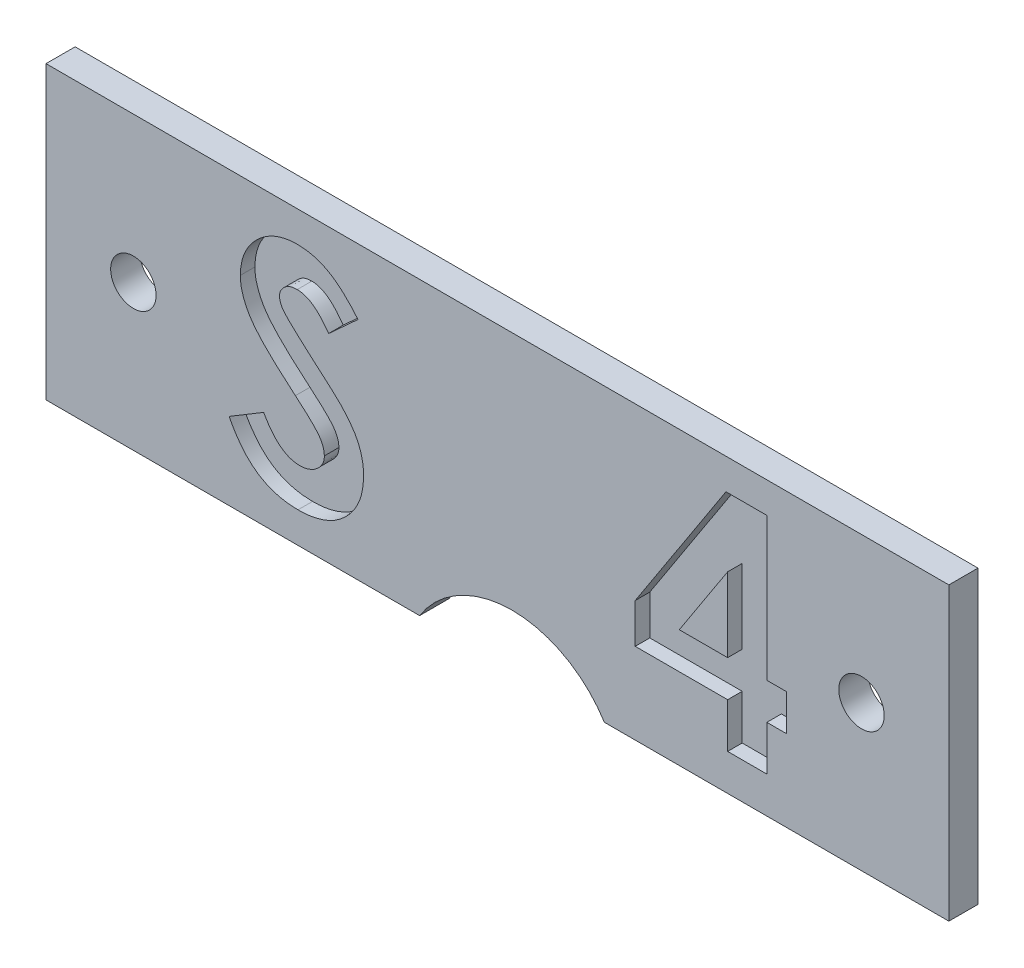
ISO-10303-21;
HEADER;
FILE_DESCRIPTION(('STEP AP214'),'2;1');
FILE_NAME('part.step','',(''),(''),'','','');
FILE_SCHEMA(('AUTOMOTIVE_DESIGN { 1 0 10303 214 1 1 1 1 }'));
ENDSEC;
DATA;
#1=APPLICATION_CONTEXT('core data for automotive mechanical design processes');
#2=APPLICATION_PROTOCOL_DEFINITION('international standard','automotive_design',2000,#1);
#3=PRODUCT_CONTEXT('',#1,'mechanical');
#4=PRODUCT('Part','Part','',(#3));
#5=PRODUCT_RELATED_PRODUCT_CATEGORY('part','',(#4));
#6=PRODUCT_DEFINITION_FORMATION('','',#4);
#7=PRODUCT_DEFINITION_CONTEXT('part definition',#1,'design');
#8=PRODUCT_DEFINITION('design','',#6,#7);
#9=PRODUCT_DEFINITION_SHAPE('','',#8);
#10=(LENGTH_UNIT() NAMED_UNIT(*) SI_UNIT(.MILLI.,.METRE.));
#11=(NAMED_UNIT(*) PLANE_ANGLE_UNIT() SI_UNIT($,.RADIAN.));
#12=(NAMED_UNIT(*) SI_UNIT($,.STERADIAN.) SOLID_ANGLE_UNIT());
#13=UNCERTAINTY_MEASURE_WITH_UNIT(LENGTH_MEASURE(1.E-05),#10,'distance_accuracy_value','');
#14=(GEOMETRIC_REPRESENTATION_CONTEXT(3) GLOBAL_UNCERTAINTY_ASSIGNED_CONTEXT((#13)) GLOBAL_UNIT_ASSIGNED_CONTEXT((#10,
#11,#12)) REPRESENTATION_CONTEXT('',''));
#15=CARTESIAN_POINT('',(0.,0.,0.));
#16=DIRECTION('',(0.,0.,1.));
#17=DIRECTION('',(1.,0.,0.));
#18=AXIS2_PLACEMENT_3D('',#15,#16,#17);
#19=CARTESIAN_POINT('',(0.,0.,2.54));
#20=DIRECTION('',(0.,1.,0.));
#21=DIRECTION('',(-1.,0.,0.));
#22=AXIS2_PLACEMENT_3D('',#19,#20,#21);
#23=PLANE('',#22);
#24=DIRECTION('',(1.,0.,0.));
#25=VECTOR('',#24,1.);
#26=CARTESIAN_POINT('',(0.,0.,0.));
#27=LINE('',#26,#25);
#28=CARTESIAN_POINT('',(-78.74,0.,0.));
#29=VERTEX_POINT('',#28);
#30=CARTESIAN_POINT('',(-46.1572467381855,0.,0.));
#31=VERTEX_POINT('',#30);
#32=EDGE_CURVE('E281',#29,#31,#27,.T.);
#33=ORIENTED_EDGE('',*,*,#32,.T.);
#34=DIRECTION('',(0.,0.,1.));
#35=VECTOR('',#34,1.);
#36=CARTESIAN_POINT('',(-46.1572467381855,0.,0.));
#37=LINE('',#36,#35);
#38=CARTESIAN_POINT('',(-46.1572467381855,0.,2.54));
#39=VERTEX_POINT('',#38);
#40=EDGE_CURVE('E41',#31,#39,#37,.T.);
#41=ORIENTED_EDGE('',*,*,#40,.T.);
#42=DIRECTION('',(1.,0.,0.));
#43=VECTOR('',#42,1.);
#44=CARTESIAN_POINT('',(0.,0.,2.54));
#45=LINE('',#44,#43);
#46=CARTESIAN_POINT('',(-78.74,0.,2.54));
#47=VERTEX_POINT('',#46);
#48=EDGE_CURVE('E295',#47,#39,#45,.T.);
#49=ORIENTED_EDGE('',*,*,#48,.F.);
#50=DIRECTION('',(0.,0.,-1.));
#51=VECTOR('',#50,1.);
#52=CARTESIAN_POINT('',(-78.74,0.,2.54));
#53=LINE('',#52,#51);
#54=EDGE_CURVE('E300',#47,#29,#53,.T.);
#55=ORIENTED_EDGE('',*,*,#54,.T.);
#56=EDGE_LOOP('',(#33,#41,#49,#55));
#57=FACE_BOUND('',#56,.T.);
#58=ADVANCED_FACE('F26',(#57),#23,.F.);
#59=CARTESIAN_POINT('',(0.,0.,2.54));
#60=DIRECTION('',(0.,0.,1.));
#61=DIRECTION('',(1.,0.,0.));
#62=AXIS2_PLACEMENT_3D('',#59,#60,#61);
#63=PLANE('',#62);
#64=CARTESIAN_POINT('',(-71.12,12.7,2.54));
#65=DIRECTION('',(0.,0.,1.));
#66=DIRECTION('',(1.,0.,0.));
#67=AXIS2_PLACEMENT_3D('',#64,#65,#66);
#68=CIRCLE('',#67,1.9812);
#69=CARTESIAN_POINT('',(-69.1388,12.7,2.54));
#70=VERTEX_POINT('',#69);
#71=EDGE_CURVE('E930',#70,#70,#68,.T.);
#72=ORIENTED_EDGE('',*,*,#71,.F.);
#73=EDGE_LOOP('',(#72));
#74=FACE_BOUND('',#73,.T.);
#75=CARTESIAN_POINT('',(-7.61999999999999,12.7,2.54));
#76=DIRECTION('',(0.,0.,1.));
#77=DIRECTION('',(1.,0.,0.));
#78=AXIS2_PLACEMENT_3D('',#75,#76,#77);
#79=CIRCLE('',#78,1.9812);
#80=CARTESIAN_POINT('',(-5.6388,12.7,2.54));
#81=VERTEX_POINT('',#80);
#82=EDGE_CURVE('E932',#81,#81,#79,.T.);
#83=ORIENTED_EDGE('',*,*,#82,.F.);
#84=EDGE_LOOP('',(#83));
#85=FACE_BOUND('',#84,.T.);
#86=CARTESIAN_POINT('',(-38.1,-5.08000000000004,2.54));
#87=DIRECTION('',(0.,0.,1.));
#88=DIRECTION('',(1.,0.,0.));
#89=AXIS2_PLACEMENT_3D('',#86,#87,#88);
#90=CIRCLE('',#89,9.52500000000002);
#91=CARTESIAN_POINT('',(-30.0427532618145,0.,2.54));
#92=VERTEX_POINT('',#91);
#93=EDGE_CURVE('E267',#92,#39,#90,.T.);
#94=ORIENTED_EDGE('',*,*,#93,.F.);
#95=CARTESIAN_POINT('',(0.,0.,2.54));
#96=VERTEX_POINT('',#95);
#97=EDGE_CURVE('E275',#92,#96,#45,.T.);
#98=ORIENTED_EDGE('',*,*,#97,.T.);
#99=DIRECTION('',(0.,1.,0.));
#100=VECTOR('',#99,1.);
#101=CARTESIAN_POINT('',(0.,0.,2.54));
#102=LINE('',#101,#100);
#103=CARTESIAN_POINT('',(0.,25.4,2.54));
#104=VERTEX_POINT('',#103);
#105=EDGE_CURVE('E284',#96,#104,#102,.T.);
#106=ORIENTED_EDGE('',*,*,#105,.T.);
#107=DIRECTION('',(-1.,0.,0.));
#108=VECTOR('',#107,1.);
#109=CARTESIAN_POINT('',(0.,25.4,2.54));
#110=LINE('',#109,#108);
#111=CARTESIAN_POINT('',(-78.74,25.4,2.54));
#112=VERTEX_POINT('',#111);
#113=EDGE_CURVE('E291',#104,#112,#110,.T.);
#114=ORIENTED_EDGE('',*,*,#113,.T.);
#115=DIRECTION('',(0.,-1.,0.));
#116=VECTOR('',#115,1.);
#117=CARTESIAN_POINT('',(-78.74,0.,2.54));
#118=LINE('',#117,#116);
#119=EDGE_CURVE('E293',#112,#47,#118,.T.);
#120=ORIENTED_EDGE('',*,*,#119,.T.);
#121=ORIENTED_EDGE('',*,*,#48,.T.);
#122=EDGE_LOOP('',(#94,#98,#106,#114,#120,#121));
#123=FACE_BOUND('',#122,.T.);
#124=CARTESIAN_POINT('',(-61.7903846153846,17.8822716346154,2.54));
#125=CARTESIAN_POINT('',(-61.7862524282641,18.0453675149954,2.54));
#126=CARTESIAN_POINT('',(-61.7781115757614,18.3666839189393,2.54));
#127=CARTESIAN_POINT('',(-61.7054939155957,18.8391328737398,2.54));
#128=CARTESIAN_POINT('',(-61.5969640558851,19.2950064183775,2.54));
#129=CARTESIAN_POINT('',(-61.4393475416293,19.7326413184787,2.54));
#130=CARTESIAN_POINT('',(-61.23478033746,20.1514894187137,2.54));
#131=CARTESIAN_POINT('',(-60.9863414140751,20.5536011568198,2.54));
#132=CARTESIAN_POINT('',(-60.6901729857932,20.9352755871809,2.54));
#133=CARTESIAN_POINT('',(-60.3564111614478,21.2962596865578,2.54));
#134=CARTESIAN_POINT('',(-59.9886910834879,21.6261580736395,2.54));
#135=CARTESIAN_POINT('',(-59.5957354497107,21.9173264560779,2.54));
#136=CARTESIAN_POINT('',(-59.1797684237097,22.1632515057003,2.54));
#137=CARTESIAN_POINT('',(-58.7433346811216,22.3672641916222,2.54));
#138=CARTESIAN_POINT('',(-58.2837298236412,22.5234229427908,2.54));
#139=CARTESIAN_POINT('',(-57.8043397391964,22.6341160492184,2.54));
#140=CARTESIAN_POINT('',(-57.3044768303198,22.6999527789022,2.54));
#141=CARTESIAN_POINT('',(-56.9644808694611,22.7089025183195,2.54));
#142=CARTESIAN_POINT('',(-56.7912860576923,22.7134615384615,2.54));
#143=B_SPLINE_CURVE_WITH_KNOTS('',3,(#124,#125,#126,#127,#128,#129,#130,#131,#132,#133,#134,
#135,#136,#137,#138,#139,#140,#141,#142),.UNSPECIFIED.,.F.,.F.,(4,1,1,1,1,1,1,1,1,1,1,1,1,1,1,1,
4),(0.,0.0631728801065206,0.124457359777,0.18484091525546,0.244566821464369,0.304319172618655,
0.365199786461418,0.427420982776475,0.491261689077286,0.555499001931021,0.618604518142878,
0.680494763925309,0.742473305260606,0.804990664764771,0.86825197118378,0.932887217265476,1.),.UNSPECIFIED.);
#144=CARTESIAN_POINT('',(-61.7903846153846,17.8822716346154,2.54));
#145=VERTEX_POINT('',#144);
#146=CARTESIAN_POINT('',(-56.7912860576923,22.7134615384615,2.54));
#147=VERTEX_POINT('',#146);
#148=EDGE_CURVE('E523',#145,#147,#143,.T.);
#149=ORIENTED_EDGE('',*,*,#148,.T.);
#150=CARTESIAN_POINT('',(-56.7912860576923,22.7134615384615,2.54));
#151=CARTESIAN_POINT('',(-56.5668341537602,22.7052506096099,2.54));
#152=CARTESIAN_POINT('',(-56.1197020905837,22.6888935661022,2.54));
#153=CARTESIAN_POINT('',(-55.4586044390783,22.5609868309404,2.54));
#154=CARTESIAN_POINT('',(-54.8128718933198,22.3598400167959,2.54));
#155=CARTESIAN_POINT('',(-54.2925285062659,22.1171785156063,2.54));
#156=CARTESIAN_POINT('',(-53.8785009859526,21.8821122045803,2.54));
#157=CARTESIAN_POINT('',(-53.561187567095,21.6656927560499,2.54));
#158=CARTESIAN_POINT('',(-53.2383040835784,21.4177726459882,2.54));
#159=CARTESIAN_POINT('',(-52.9072466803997,21.1375706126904,2.54));
#160=CARTESIAN_POINT('',(-52.5741669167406,20.8198072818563,2.54));
#161=CARTESIAN_POINT('',(-52.229593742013,20.4720472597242,2.54));
#162=CARTESIAN_POINT('',(-51.878222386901,20.0912850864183,2.54));
#163=CARTESIAN_POINT('',(-51.6498867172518,19.8192703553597,2.54));
#164=CARTESIAN_POINT('',(-51.5326923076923,19.6796574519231,2.54));
#165=B_SPLINE_CURVE_WITH_KNOTS('',3,(#150,#151,#152,#153,#154,#155,#156,#157,#158,#159,#160,
#161,#162,#163,#164),.UNSPECIFIED.,.F.,.F.,(4,1,1,1,1,1,1,1,1,1,1,1,4),(0.,0.1069102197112,
0.212976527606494,0.319776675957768,0.428556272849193,0.485856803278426,0.546558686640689,
0.611431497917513,0.679820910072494,0.753158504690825,0.830752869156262,0.913133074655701,1.),.UNSPECIFIED.);
#166=CARTESIAN_POINT('',(-51.5326923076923,19.6796574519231,2.54));
#167=VERTEX_POINT('',#166);
#168=EDGE_CURVE('E645',#147,#167,#165,.T.);
#169=ORIENTED_EDGE('',*,*,#168,.T.);
#170=DIRECTION('',(-0.73779374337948,-0.675026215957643,0.));
#171=VECTOR('',#170,1.);
#172=CARTESIAN_POINT('',(-51.5326923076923,19.6796574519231,2.54));
#173=LINE('',#172,#171);
#174=CARTESIAN_POINT('',(-54.0894831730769,17.3403846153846,2.54));
#175=VERTEX_POINT('',#174);
#176=EDGE_CURVE('E1046',#167,#175,#173,.T.);
#177=ORIENTED_EDGE('',*,*,#176,.T.);
#178=CARTESIAN_POINT('',(-54.0894831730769,17.3403846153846,2.54));
#179=CARTESIAN_POINT('',(-54.1990051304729,17.4948767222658,2.54));
#180=CARTESIAN_POINT('',(-54.4092720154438,17.791480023,2.54));
#181=CARTESIAN_POINT('',(-54.7500927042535,18.188638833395,2.54));
#182=CARTESIAN_POINT('',(-55.089374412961,18.5274448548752,2.54));
#183=CARTESIAN_POINT('',(-55.430260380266,18.8064827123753,2.54));
#184=CARTESIAN_POINT('',(-55.7757720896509,19.0240570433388,2.54));
#185=CARTESIAN_POINT('',(-56.1253097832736,19.178102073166,2.54));
#186=CARTESIAN_POINT('',(-56.4768918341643,19.2760299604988,2.54));
#187=CARTESIAN_POINT('',(-56.7131007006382,19.2882243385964,2.54));
#188=CARTESIAN_POINT('',(-56.8294471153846,19.2942307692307,2.54));
#189=B_SPLINE_CURVE_WITH_KNOTS('',3,(#178,#179,#180,#181,#182,#183,#184,#185,#186,#187,#188),
.UNSPECIFIED.,.F.,.F.,(4,1,1,1,1,1,1,1,4),(0.,0.162420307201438,0.311824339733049,
0.448432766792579,0.573381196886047,0.689077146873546,0.797572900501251,0.900293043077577,1.),.UNSPECIFIED.);
#190=CARTESIAN_POINT('',(-56.8294471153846,19.2942307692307,2.54));
#191=VERTEX_POINT('',#190);
#192=EDGE_CURVE('E562',#175,#191,#189,.T.);
#193=ORIENTED_EDGE('',*,*,#192,.T.);
#194=CARTESIAN_POINT('',(-56.8294471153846,19.2942307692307,2.54));
#195=CARTESIAN_POINT('',(-56.9379717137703,19.2904248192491,2.54));
#196=CARTESIAN_POINT('',(-57.1475042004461,19.2830765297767,2.54));
#197=CARTESIAN_POINT('',(-57.4462083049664,19.2100350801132,2.54));
#198=CARTESIAN_POINT('',(-57.711402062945,19.0839762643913,2.54));
#199=CARTESIAN_POINT('',(-57.9428266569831,18.9191437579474,2.54));
#200=CARTESIAN_POINT('',(-58.1261490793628,18.720558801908,2.54));
#201=CARTESIAN_POINT('',(-58.2725178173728,18.5122942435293,2.54));
#202=CARTESIAN_POINT('',(-58.354935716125,18.2824172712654,2.54));
#203=CARTESIAN_POINT('',(-58.365783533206,18.1245284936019,2.54));
#204=CARTESIAN_POINT('',(-58.3711538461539,18.0463641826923,2.54));
#205=B_SPLINE_CURVE_WITH_KNOTS('',3,(#194,#195,#196,#197,#198,#199,#200,#201,#202,#203,#204),
.UNSPECIFIED.,.F.,.F.,(4,1,1,1,1,1,1,1,4),(0.,0.148126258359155,0.285992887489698,
0.416634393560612,0.547379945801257,0.671582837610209,0.784400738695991,0.893265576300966,1.),.UNSPECIFIED.);
#206=CARTESIAN_POINT('',(-58.3711538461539,18.0463641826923,2.54));
#207=VERTEX_POINT('',#206);
#208=EDGE_CURVE('E540',#191,#207,#205,.T.);
#209=ORIENTED_EDGE('',*,*,#208,.T.);
#210=CARTESIAN_POINT('',(-58.3711538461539,18.0463641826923,2.54));
#211=CARTESIAN_POINT('',(-58.3677885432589,17.96707270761,2.54));
#212=CARTESIAN_POINT('',(-58.3610112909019,17.8073906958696,2.54));
#213=CARTESIAN_POINT('',(-58.2955522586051,17.5733568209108,2.54));
#214=CARTESIAN_POINT('',(-58.1968868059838,17.3446784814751,2.54));
#215=CARTESIAN_POINT('',(-58.1026079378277,17.2054710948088,2.54));
#216=CARTESIAN_POINT('',(-58.0544170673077,17.1343149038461,2.54));
#217=B_SPLINE_CURVE_WITH_KNOTS('',3,(#210,#211,#212,#213,#214,#215,#216),.UNSPECIFIED.,.F.,.F.,
(4,1,1,1,4),(0.,0.241881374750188,0.487115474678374,0.737837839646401,1.),.UNSPECIFIED.);
#218=CARTESIAN_POINT('',(-58.0544170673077,17.1343149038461,2.54));
#219=VERTEX_POINT('',#218);
#220=EDGE_CURVE('E557',#207,#219,#217,.T.);
#221=ORIENTED_EDGE('',*,*,#220,.T.);
#222=CARTESIAN_POINT('',(-58.0544170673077,17.1343149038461,2.54));
#223=CARTESIAN_POINT('',(-58.0106063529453,17.0790059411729,2.54));
#224=CARTESIAN_POINT('',(-57.9097598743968,16.9516920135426,2.54));
#225=CARTESIAN_POINT('',(-57.7174662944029,16.750046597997,2.54));
#226=CARTESIAN_POINT('',(-57.4759859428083,16.5030133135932,2.54));
#227=CARTESIAN_POINT('',(-57.17602614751,16.2190869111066,2.54));
#228=CARTESIAN_POINT('',(-56.8300390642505,15.8880562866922,2.54));
#229=CARTESIAN_POINT('',(-56.421987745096,15.5229343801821,2.54));
#230=CARTESIAN_POINT('',(-55.9636176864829,15.1124137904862,2.54));
#231=CARTESIAN_POINT('',(-55.6378188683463,14.8265421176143,2.54));
#232=CARTESIAN_POINT('',(-55.4670973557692,14.6767427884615,2.54));
#233=B_SPLINE_CURVE_WITH_KNOTS('',3,(#222,#223,#224,#225,#226,#227,#228,#229,#230,#231,#232),
.UNSPECIFIED.,.F.,.F.,(4,1,1,1,1,1,1,1,4),(0.,0.0592341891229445,0.13634928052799,
0.233805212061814,0.349411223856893,0.483179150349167,0.635966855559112,0.80924335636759,1.),.UNSPECIFIED.);
#234=CARTESIAN_POINT('',(-55.4670973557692,14.6767427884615,2.54));
#235=VERTEX_POINT('',#234);
#236=EDGE_CURVE('E552',#219,#235,#233,.T.);
#237=ORIENTED_EDGE('',*,*,#236,.T.);
#238=CARTESIAN_POINT('',(-55.4670973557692,14.6767427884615,2.54));
#239=CARTESIAN_POINT('',(-55.3068506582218,14.5380573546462,2.54));
#240=CARTESIAN_POINT('',(-55.0027357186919,14.2748612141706,2.54));
#241=CARTESIAN_POINT('',(-54.5700405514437,13.901296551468,2.54));
#242=CARTESIAN_POINT('',(-54.1897735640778,13.5652095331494,2.54));
#243=CARTESIAN_POINT('',(-53.8563951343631,13.2716441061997,2.54));
#244=CARTESIAN_POINT('',(-53.574958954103,13.0175200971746,2.54));
#245=CARTESIAN_POINT('',(-53.3442818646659,12.8016227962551,2.54));
#246=CARTESIAN_POINT('',(-53.1615465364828,12.6281553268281,2.54));
#247=CARTESIAN_POINT('',(-53.0576722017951,12.5233808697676,2.54));
#248=CARTESIAN_POINT('',(-53.0133413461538,12.4786658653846,2.54));
#249=B_SPLINE_CURVE_WITH_KNOTS('',3,(#238,#239,#240,#241,#242,#243,#244,#245,#246,#247,#248),
.UNSPECIFIED.,.F.,.F.,(4,1,1,1,1,1,1,1,4),(0.,0.192952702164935,0.366184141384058,
0.520457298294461,0.65501213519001,0.770624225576,0.865677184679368,0.942674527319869,1.),.UNSPECIFIED.);
#250=CARTESIAN_POINT('',(-53.0133413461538,12.4786658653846,2.54));
#251=VERTEX_POINT('',#250);
#252=EDGE_CURVE('E556',#235,#251,#249,.T.);
#253=ORIENTED_EDGE('',*,*,#252,.T.);
#254=CARTESIAN_POINT('',(-53.0133413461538,12.4786658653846,2.54));
#255=CARTESIAN_POINT('',(-52.8451593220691,12.2966568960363,2.54));
#256=CARTESIAN_POINT('',(-52.5218544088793,11.9467717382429,2.54));
#257=CARTESIAN_POINT('',(-52.1016719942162,11.4045597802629,2.54));
#258=CARTESIAN_POINT('',(-51.7558482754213,10.8752503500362,2.54));
#259=CARTESIAN_POINT('',(-51.4883124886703,10.3488836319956,2.54));
#260=CARTESIAN_POINT('',(-51.2862587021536,9.81786520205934,2.54));
#261=CARTESIAN_POINT('',(-51.1438081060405,9.26917186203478,2.54));
#262=CARTESIAN_POINT('',(-51.0584934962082,8.697070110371,2.54));
#263=CARTESIAN_POINT('',(-51.0490215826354,8.30668050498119,2.54));
#264=CARTESIAN_POINT('',(-51.0442307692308,8.10922475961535,2.54));
#265=B_SPLINE_CURVE_WITH_KNOTS('',3,(#254,#255,#256,#257,#258,#259,#260,#261,#262,#263,#264),
.UNSPECIFIED.,.F.,.F.,(4,1,1,1,1,1,1,1,4),(0.,0.150833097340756,0.289954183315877,
0.417138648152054,0.535255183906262,0.648751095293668,0.762405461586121,0.879826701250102,1.),.UNSPECIFIED.);
#266=CARTESIAN_POINT('',(-51.0442307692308,8.10922475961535,2.54));
#267=VERTEX_POINT('',#266);
#268=EDGE_CURVE('E581',#251,#267,#265,.T.);
#269=ORIENTED_EDGE('',*,*,#268,.T.);
#270=CARTESIAN_POINT('',(-51.0442307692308,8.10922475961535,2.54));
#271=CARTESIAN_POINT('',(-51.0476407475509,7.91682835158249,2.54));
#272=CARTESIAN_POINT('',(-51.0543312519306,7.53933943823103,2.54));
#273=CARTESIAN_POINT('',(-51.1362771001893,6.98694064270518,2.54));
#274=CARTESIAN_POINT('',(-51.2531270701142,6.45827102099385,2.54));
#275=CARTESIAN_POINT('',(-51.4337976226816,5.95908324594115,2.54));
#276=CARTESIAN_POINT('',(-51.6539978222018,5.48118330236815,2.54));
#277=CARTESIAN_POINT('',(-51.9300505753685,5.03201535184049,2.54));
#278=CARTESIAN_POINT('',(-52.2542366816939,4.60703363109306,2.54));
#279=CARTESIAN_POINT('',(-52.6258037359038,4.2138352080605,2.54));
#280=CARTESIAN_POINT('',(-53.0368010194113,3.85703489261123,2.54));
#281=CARTESIAN_POINT('',(-53.4776346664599,3.53940282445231,2.54));
#282=CARTESIAN_POINT('',(-53.9526153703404,3.27715709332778,2.54));
#283=CARTESIAN_POINT('',(-54.4576849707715,3.06121643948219,2.54));
#284=CARTESIAN_POINT('',(-54.9925731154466,2.89489606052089,2.54));
#285=CARTESIAN_POINT('',(-55.5566425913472,2.77196979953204,2.54));
#286=CARTESIAN_POINT('',(-56.1507561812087,2.69819139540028,2.54));
#287=CARTESIAN_POINT('',(-56.5570196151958,2.69047873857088,2.54));
#288=CARTESIAN_POINT('',(-56.7645733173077,2.68653846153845,2.54));
#289=B_SPLINE_CURVE_WITH_KNOTS('',3,(#270,#271,#272,#273,#274,#275,#276,#277,#278,#279,#280,
#281,#282,#283,#284,#285,#286,#287,#288),.UNSPECIFIED.,.F.,.F.,(4,1,1,1,1,1,1,1,1,1,1,1,1,1,1,1,
4),(0.,0.0652008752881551,0.127926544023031,0.189046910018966,0.248543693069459,
0.307607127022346,0.367247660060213,0.426963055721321,0.488617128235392,0.550391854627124,
0.61133073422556,0.672556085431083,0.734024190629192,0.797340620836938,0.862249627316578,
0.929625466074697,1.),.UNSPECIFIED.);
#290=CARTESIAN_POINT('',(-56.7645733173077,2.68653846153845,2.54));
#291=VERTEX_POINT('',#290);
#292=EDGE_CURVE('E589',#267,#291,#289,.T.);
#293=ORIENTED_EDGE('',*,*,#292,.T.);
#294=CARTESIAN_POINT('',(-56.7645733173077,2.68653846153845,2.54));
#295=CARTESIAN_POINT('',(-56.9275012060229,2.68942891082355,2.54));
#296=CARTESIAN_POINT('',(-57.2501918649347,2.69515365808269,2.54));
#297=CARTESIAN_POINT('',(-57.7257891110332,2.74189145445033,2.54));
#298=CARTESIAN_POINT('',(-58.185032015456,2.81732128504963,2.54));
#299=CARTESIAN_POINT('',(-58.6274032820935,2.92543476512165,2.54));
#300=CARTESIAN_POINT('',(-59.0548958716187,3.06242920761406,2.54));
#301=CARTESIAN_POINT('',(-59.4675273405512,3.2297626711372,2.54));
#302=CARTESIAN_POINT('',(-59.8624491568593,3.4300287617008,2.54));
#303=CARTESIAN_POINT('',(-60.2426494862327,3.65910921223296,2.54));
#304=CARTESIAN_POINT('',(-60.6062800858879,3.92510179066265,2.54));
#305=CARTESIAN_POINT('',(-60.957938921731,4.22256836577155,2.54));
#306=CARTESIAN_POINT('',(-61.29413298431,4.55608410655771,2.54));
#307=CARTESIAN_POINT('',(-61.6164769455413,4.92486026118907,2.54));
#308=CARTESIAN_POINT('',(-61.9229083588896,5.32994111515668,2.54));
#309=CARTESIAN_POINT('',(-62.2234578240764,5.76568516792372,2.54));
#310=CARTESIAN_POINT('',(-62.5047680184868,6.24017923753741,2.54));
#311=CARTESIAN_POINT('',(-62.6785458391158,6.57304066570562,2.54));
#312=CARTESIAN_POINT('',(-62.7673076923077,6.74305889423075,2.54));
#313=B_SPLINE_CURVE_WITH_KNOTS('',3,(#294,#295,#296,#297,#298,#299,#300,#301,#302,#303,#304,
#305,#306,#307,#308,#309,#310,#311,#312),.UNSPECIFIED.,.F.,.F.,(4,1,1,1,1,1,1,1,1,1,1,1,1,1,1,1,
4),(0.,0.0635514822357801,0.125868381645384,0.186240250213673,0.244976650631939,
0.30335768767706,0.361230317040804,0.418489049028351,0.475936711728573,0.534203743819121,
0.594059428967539,0.655468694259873,0.718771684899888,0.784974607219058,0.853522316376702,
0.925182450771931,1.),.UNSPECIFIED.);
#314=CARTESIAN_POINT('',(-62.7673076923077,6.74305889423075,2.54));
#315=VERTEX_POINT('',#314);
#316=EDGE_CURVE('E597',#291,#315,#313,.T.);
#317=ORIENTED_EDGE('',*,*,#316,.T.);
#318=DIRECTION('',(0.857396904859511,0.514655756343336,0.));
#319=VECTOR('',#318,1.);
#320=CARTESIAN_POINT('',(-62.7673076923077,6.74305889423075,2.54));
#321=LINE('',#320,#319);
#322=CARTESIAN_POINT('',(-59.7602163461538,8.54807692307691,2.54));
#323=VERTEX_POINT('',#322);
#324=EDGE_CURVE('E605',#315,#323,#321,.T.);
#325=ORIENTED_EDGE('',*,*,#324,.T.);
#326=CARTESIAN_POINT('',(-59.7602163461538,8.54807692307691,2.54));
#327=CARTESIAN_POINT('',(-59.649188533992,8.35508401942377,2.54));
#328=CARTESIAN_POINT('',(-59.4363387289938,7.98510012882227,2.54));
#329=CARTESIAN_POINT('',(-59.0756448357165,7.48797987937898,2.54));
#330=CARTESIAN_POINT('',(-58.7061323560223,7.06227867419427,2.54));
#331=CARTESIAN_POINT('',(-58.3192584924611,6.71552080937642,2.54));
#332=CARTESIAN_POINT('',(-57.919727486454,6.44306968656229,2.54));
#333=CARTESIAN_POINT('',(-57.5056095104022,6.24835721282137,2.54));
#334=CARTESIAN_POINT('',(-57.0766136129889,6.12783041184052,2.54));
#335=CARTESIAN_POINT('',(-56.7844010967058,6.11311130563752,2.54));
#336=CARTESIAN_POINT('',(-56.6386418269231,6.10576923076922,2.54));
#337=B_SPLINE_CURVE_WITH_KNOTS('',3,(#326,#327,#328,#329,#330,#331,#332,#333,#334,#335,#336),
.UNSPECIFIED.,.F.,.F.,(4,1,1,1,1,1,1,1,4),(0.,0.160457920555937,0.307611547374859,
0.442138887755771,0.566229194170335,0.681222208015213,0.789558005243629,0.895028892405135,1.),.UNSPECIFIED.);
#338=CARTESIAN_POINT('',(-56.6386418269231,6.10576923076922,2.54));
#339=VERTEX_POINT('',#338);
#340=EDGE_CURVE('E611',#323,#339,#337,.T.);
#341=ORIENTED_EDGE('',*,*,#340,.T.);
#342=CARTESIAN_POINT('',(-56.6386418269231,6.10576923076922,2.54));
#343=CARTESIAN_POINT('',(-56.4903837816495,6.11176516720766,2.54));
#344=CARTESIAN_POINT('',(-56.2027415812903,6.1233981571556,2.54));
#345=CARTESIAN_POINT('',(-55.7921691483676,6.23084857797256,2.54));
#346=CARTESIAN_POINT('',(-55.4157407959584,6.39955362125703,2.54));
#347=CARTESIAN_POINT('',(-55.0903589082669,6.64027245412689,2.54));
#348=CARTESIAN_POINT('',(-54.8148460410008,6.91809857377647,2.54));
#349=CARTESIAN_POINT('',(-54.6115017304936,7.22719283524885,2.54));
#350=CARTESIAN_POINT('',(-54.4837594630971,7.56162536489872,2.54));
#351=CARTESIAN_POINT('',(-54.4702540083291,7.79394419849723,2.54));
#352=CARTESIAN_POINT('',(-54.4634615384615,7.91078725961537,2.54));
#353=B_SPLINE_CURVE_WITH_KNOTS('',3,(#342,#343,#344,#345,#346,#347,#348,#349,#350,#351,#352),
.UNSPECIFIED.,.F.,.F.,(4,1,1,1,1,1,1,1,4),(0.,0.141985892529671,0.275473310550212,
0.404345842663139,0.535429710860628,0.661427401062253,0.77786684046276,0.888279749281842,1.),.UNSPECIFIED.);
#354=CARTESIAN_POINT('',(-54.4634615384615,7.91078725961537,2.54));
#355=VERTEX_POINT('',#354);
#356=EDGE_CURVE('E616',#339,#355,#353,.T.);
#357=ORIENTED_EDGE('',*,*,#356,.T.);
#358=CARTESIAN_POINT('',(-54.4634615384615,7.91078725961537,2.54));
#359=CARTESIAN_POINT('',(-54.4697341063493,8.01949071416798,2.54));
#360=CARTESIAN_POINT('',(-54.4824762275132,8.24031137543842,2.54));
#361=CARTESIAN_POINT('',(-54.5763307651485,8.56863619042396,2.54));
#362=CARTESIAN_POINT('',(-54.7230540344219,8.89681169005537,2.54));
#363=CARTESIAN_POINT('',(-54.896638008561,9.16599011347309,2.54));
#364=CARTESIAN_POINT('',(-55.0732814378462,9.39136591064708,2.54));
#365=CARTESIAN_POINT('',(-55.2421923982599,9.58664384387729,2.54));
#366=CARTESIAN_POINT('',(-55.4478812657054,9.80239177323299,2.54));
#367=CARTESIAN_POINT('',(-55.6898265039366,10.0388810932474,2.54));
#368=CARTESIAN_POINT('',(-55.9648313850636,10.2981936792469,2.54));
#369=CARTESIAN_POINT('',(-56.2731275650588,10.5803041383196,2.54));
#370=CARTESIAN_POINT('',(-56.6182453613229,10.8827274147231,2.54));
#371=CARTESIAN_POINT('',(-56.8621753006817,11.0887351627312,2.54));
#372=CARTESIAN_POINT('',(-56.9897235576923,11.1964543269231,2.54));
#373=B_SPLINE_CURVE_WITH_KNOTS('',3,(#358,#359,#360,#361,#362,#363,#364,#365,#366,#367,#368,
#369,#370,#371,#372),.UNSPECIFIED.,.F.,.F.,(4,1,1,1,1,1,1,1,1,1,1,1,4),(0.,0.0763466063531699,
0.155090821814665,0.238351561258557,0.328404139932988,0.37938385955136,0.439617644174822,
0.509831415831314,0.588874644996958,0.67743635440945,0.775546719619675,0.882635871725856,1.),.UNSPECIFIED.);
#374=CARTESIAN_POINT('',(-56.9897235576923,11.1964543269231,2.54));
#375=VERTEX_POINT('',#374);
#376=EDGE_CURVE('E624',#355,#375,#373,.T.);
#377=ORIENTED_EDGE('',*,*,#376,.T.);
#378=CARTESIAN_POINT('',(-56.9897235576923,11.1964543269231,2.54));
#379=CARTESIAN_POINT('',(-57.2321978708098,11.4016108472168,2.54));
#380=CARTESIAN_POINT('',(-57.6975794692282,11.7953683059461,2.54));
#381=CARTESIAN_POINT('',(-58.35522271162,12.3769356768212,2.54));
#382=CARTESIAN_POINT('',(-58.9478181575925,12.9204636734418,2.54));
#383=CARTESIAN_POINT('',(-59.4702475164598,13.4326714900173,2.54));
#384=CARTESIAN_POINT('',(-59.9291673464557,13.9040998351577,2.54));
#385=CARTESIAN_POINT('',(-60.3214696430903,14.3385778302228,2.54));
#386=CARTESIAN_POINT('',(-60.6428447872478,14.7394568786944,2.54));
#387=CARTESIAN_POINT('',(-60.9810228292,15.2142712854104,2.54));
#388=CARTESIAN_POINT('',(-61.3023595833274,15.7928652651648,2.54));
#389=CARTESIAN_POINT('',(-61.5800857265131,16.4889808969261,2.54));
#390=CARTESIAN_POINT('',(-61.7602627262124,17.185008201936,2.54));
#391=CARTESIAN_POINT('',(-61.7804490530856,17.6522825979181,2.54));
#392=CARTESIAN_POINT('',(-61.7903846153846,17.8822716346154,2.54));
#393=B_SPLINE_CURVE_WITH_KNOTS('',3,(#378,#379,#380,#381,#382,#383,#384,#385,#386,#387,#388,
#389,#390,#391,#392),.UNSPECIFIED.,.F.,.F.,(4,1,1,1,1,1,1,1,1,1,1,1,4),(0.,0.112124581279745,
0.215201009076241,0.309902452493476,0.395959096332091,0.473447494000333,0.542140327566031,
0.602523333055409,0.654726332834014,0.747804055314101,0.835278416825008,0.918925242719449,1.),.UNSPECIFIED.);
#394=EDGE_CURVE('E631',#375,#145,#393,.T.);
#395=ORIENTED_EDGE('',*,*,#394,.T.);
#396=EDGE_LOOP('',(#149,#169,#177,#193,#209,#221,#237,#253,#269,#293,#317,#325,#341,#357,#377,#395));
#397=FACE_BOUND('',#396,.T.);
#398=DIRECTION('',(0.,1.,0.));
#399=VECTOR('',#398,1.);
#400=CARTESIAN_POINT('',(-27.3538461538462,7.08269230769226,2.54));
#401=LINE('',#400,#399);
#402=CARTESIAN_POINT('',(-27.3538461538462,7.08269230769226,2.54));
#403=VERTEX_POINT('',#402);
#404=CARTESIAN_POINT('',(-27.3538461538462,10.5439002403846,2.54));
#405=VERTEX_POINT('',#404);
#406=EDGE_CURVE('E995',#403,#405,#401,.T.);
#407=ORIENTED_EDGE('',*,*,#406,.T.);
#408=DIRECTION('',(0.545200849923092,0.838305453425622,0.));
#409=VECTOR('',#408,1.);
#410=CARTESIAN_POINT('',(-27.3538461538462,10.5439002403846,2.54));
#411=LINE('',#410,#409);
#412=CARTESIAN_POINT('',(-19.4392427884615,22.7134615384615,2.54));
#413=VERTEX_POINT('',#412);
#414=EDGE_CURVE('E49',#405,#413,#411,.T.);
#415=ORIENTED_EDGE('',*,*,#414,.T.);
#416=DIRECTION('',(1.,0.,0.));
#417=VECTOR('',#416,1.);
#418=CARTESIAN_POINT('',(-19.4392427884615,22.7134615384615,2.54));
#419=LINE('',#418,#417);
#420=CARTESIAN_POINT('',(-15.875,22.7134615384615,2.54));
#421=VERTEX_POINT('',#420);
#422=EDGE_CURVE('E968',#413,#421,#419,.T.);
#423=ORIENTED_EDGE('',*,*,#422,.T.);
#424=DIRECTION('',(0.,-1.,0.));
#425=VECTOR('',#424,1.);
#426=CARTESIAN_POINT('',(-15.875,22.7134615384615,2.54));
#427=LINE('',#426,#425);
#428=CARTESIAN_POINT('',(-15.875,10.2576923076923,2.54));
#429=VERTEX_POINT('',#428);
#430=EDGE_CURVE('E971',#421,#429,#427,.T.);
#431=ORIENTED_EDGE('',*,*,#430,.T.);
#432=DIRECTION('',(1.,0.,0.));
#433=VECTOR('',#432,1.);
#434=CARTESIAN_POINT('',(-15.875,10.2576923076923,2.54));
#435=LINE('',#434,#433);
#436=CARTESIAN_POINT('',(-14.1653846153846,10.2576923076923,2.54));
#437=VERTEX_POINT('',#436);
#438=EDGE_CURVE('E974',#429,#437,#435,.T.);
#439=ORIENTED_EDGE('',*,*,#438,.T.);
#440=DIRECTION('',(0.,-1.,0.));
#441=VECTOR('',#440,1.);
#442=CARTESIAN_POINT('',(-14.1653846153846,10.2576923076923,2.54));
#443=LINE('',#442,#441);
#444=CARTESIAN_POINT('',(-14.1653846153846,7.0826923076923,2.54));
#445=VERTEX_POINT('',#444);
#446=EDGE_CURVE('E977',#437,#445,#443,.T.);
#447=ORIENTED_EDGE('',*,*,#446,.T.);
#448=DIRECTION('',(-1.,0.,0.));
#449=VECTOR('',#448,1.);
#450=CARTESIAN_POINT('',(-14.1653846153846,7.0826923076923,2.54));
#451=LINE('',#450,#449);
#452=CARTESIAN_POINT('',(-15.875,7.0826923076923,2.54));
#453=VERTEX_POINT('',#452);
#454=EDGE_CURVE('E980',#445,#453,#451,.T.);
#455=ORIENTED_EDGE('',*,*,#454,.T.);
#456=DIRECTION('',(0.,-1.,0.));
#457=VECTOR('',#456,1.);
#458=CARTESIAN_POINT('',(-15.875,7.0826923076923,2.54));
#459=LINE('',#458,#457);
#460=CARTESIAN_POINT('',(-15.875,3.175,2.54));
#461=VERTEX_POINT('',#460);
#462=EDGE_CURVE('E983',#453,#461,#459,.T.);
#463=ORIENTED_EDGE('',*,*,#462,.T.);
#464=DIRECTION('',(-1.,0.,0.));
#465=VECTOR('',#464,1.);
#466=CARTESIAN_POINT('',(-15.875,3.175,2.54));
#467=LINE('',#466,#465);
#468=CARTESIAN_POINT('',(-19.2942307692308,3.175,2.54));
#469=VERTEX_POINT('',#468);
#470=EDGE_CURVE('E986',#461,#469,#467,.T.);
#471=ORIENTED_EDGE('',*,*,#470,.T.);
#472=DIRECTION('',(0.,1.,0.));
#473=VECTOR('',#472,1.);
#474=CARTESIAN_POINT('',(-19.2942307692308,3.175,2.54));
#475=LINE('',#474,#473);
#476=CARTESIAN_POINT('',(-19.2942307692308,7.0826923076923,2.54));
#477=VERTEX_POINT('',#476);
#478=EDGE_CURVE('E989',#469,#477,#475,.T.);
#479=ORIENTED_EDGE('',*,*,#478,.T.);
#480=DIRECTION('',(-1.,0.,0.));
#481=VECTOR('',#480,1.);
#482=CARTESIAN_POINT('',(-19.2942307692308,7.0826923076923,2.54));
#483=LINE('',#482,#481);
#484=EDGE_CURVE('E992',#477,#403,#483,.T.);
#485=ORIENTED_EDGE('',*,*,#484,.T.);
#486=EDGE_LOOP('',(#407,#415,#423,#431,#439,#447,#455,#463,#471,#479,#485));
#487=FACE_BOUND('',#486,.T.);
#488=ADVANCED_FACE('F313',(#74,#85,#123,#397,#487),#63,.T.);
#489=CARTESIAN_POINT('',(0.,0.,2.54));
#490=DIRECTION('',(-1.,0.,0.));
#491=DIRECTION('',(0.,0.,1.));
#492=AXIS2_PLACEMENT_3D('',#489,#490,#491);
#493=PLANE('',#492);
#494=DIRECTION('',(0.,1.,0.));
#495=VECTOR('',#494,1.);
#496=CARTESIAN_POINT('',(0.,0.,0.));
#497=LINE('',#496,#495);
#498=CARTESIAN_POINT('',(0.,0.,0.));
#499=VERTEX_POINT('',#498);
#500=CARTESIAN_POINT('',(0.,25.4,0.));
#501=VERTEX_POINT('',#500);
#502=EDGE_CURVE('E280',#499,#501,#497,.T.);
#503=ORIENTED_EDGE('',*,*,#502,.T.);
#504=DIRECTION('',(0.,0.,-1.));
#505=VECTOR('',#504,1.);
#506=CARTESIAN_POINT('',(0.,25.4,2.54));
#507=LINE('',#506,#505);
#508=EDGE_CURVE('E11',#104,#501,#507,.T.);
#509=ORIENTED_EDGE('',*,*,#508,.F.);
#510=ORIENTED_EDGE('',*,*,#105,.F.);
#511=DIRECTION('',(0.,0.,-1.));
#512=VECTOR('',#511,1.);
#513=CARTESIAN_POINT('',(0.,0.,2.54));
#514=LINE('',#513,#512);
#515=EDGE_CURVE('E298',#96,#499,#514,.T.);
#516=ORIENTED_EDGE('',*,*,#515,.T.);
#517=EDGE_LOOP('',(#503,#509,#510,#516));
#518=FACE_BOUND('',#517,.T.);
#519=ADVANCED_FACE('F28',(#518),#493,.F.);
#520=CARTESIAN_POINT('',(0.,25.4,2.54));
#521=DIRECTION('',(0.,-1.,0.));
#522=DIRECTION('',(1.,0.,0.));
#523=AXIS2_PLACEMENT_3D('',#520,#521,#522);
#524=PLANE('',#523);
#525=DIRECTION('',(-1.,0.,0.));
#526=VECTOR('',#525,1.);
#527=CARTESIAN_POINT('',(0.,25.4,0.));
#528=LINE('',#527,#526);
#529=CARTESIAN_POINT('',(-78.74,25.4,0.));
#530=VERTEX_POINT('',#529);
#531=EDGE_CURVE('E285',#501,#530,#528,.T.);
#532=ORIENTED_EDGE('',*,*,#531,.T.);
#533=DIRECTION('',(0.,0.,-1.));
#534=VECTOR('',#533,1.);
#535=CARTESIAN_POINT('',(-78.74,25.4,2.54));
#536=LINE('',#535,#534);
#537=EDGE_CURVE('E34',#112,#530,#536,.T.);
#538=ORIENTED_EDGE('',*,*,#537,.F.);
#539=ORIENTED_EDGE('',*,*,#113,.F.);
#540=ORIENTED_EDGE('',*,*,#508,.T.);
#541=EDGE_LOOP('',(#532,#538,#539,#540));
#542=FACE_BOUND('',#541,.T.);
#543=ADVANCED_FACE('F317',(#542),#524,.F.);
#544=CARTESIAN_POINT('',(-78.74,0.,2.54));
#545=DIRECTION('',(1.,0.,0.));
#546=DIRECTION('',(0.,0.,-1.));
#547=AXIS2_PLACEMENT_3D('',#544,#545,#546);
#548=PLANE('',#547);
#549=DIRECTION('',(0.,-1.,0.));
#550=VECTOR('',#549,1.);
#551=CARTESIAN_POINT('',(-78.74,0.,0.));
#552=LINE('',#551,#550);
#553=EDGE_CURVE('E282',#530,#29,#552,.T.);
#554=ORIENTED_EDGE('',*,*,#553,.T.);
#555=ORIENTED_EDGE('',*,*,#54,.F.);
#556=ORIENTED_EDGE('',*,*,#119,.F.);
#557=ORIENTED_EDGE('',*,*,#537,.T.);
#558=EDGE_LOOP('',(#554,#555,#556,#557));
#559=FACE_BOUND('',#558,.T.);
#560=ADVANCED_FACE('F307',(#559),#548,.F.);
#561=ORIENTED_EDGE('',*,*,#97,.F.);
#562=DIRECTION('',(0.,0.,1.));
#563=VECTOR('',#562,1.);
#564=CARTESIAN_POINT('',(-30.0427532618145,0.,0.));
#565=LINE('',#564,#563);
#566=CARTESIAN_POINT('',(-30.0427532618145,0.,0.));
#567=VERTEX_POINT('',#566);
#568=EDGE_CURVE('E261',#92,#567,#565,.F.);
#569=ORIENTED_EDGE('',*,*,#568,.T.);
#570=EDGE_CURVE('E273',#567,#499,#27,.T.);
#571=ORIENTED_EDGE('',*,*,#570,.T.);
#572=ORIENTED_EDGE('',*,*,#515,.F.);
#573=EDGE_LOOP('',(#561,#569,#571,#572));
#574=FACE_BOUND('',#573,.T.);
#575=ADVANCED_FACE('F271',(#574),#23,.F.);
#576=CARTESIAN_POINT('',(0.,0.,0.));
#577=DIRECTION('',(0.,0.,1.));
#578=DIRECTION('',(1.,0.,0.));
#579=AXIS2_PLACEMENT_3D('',#576,#577,#578);
#580=PLANE('',#579);
#581=CARTESIAN_POINT('',(-71.12,12.7,0.));
#582=DIRECTION('',(0.,0.,1.));
#583=DIRECTION('',(1.,0.,0.));
#584=AXIS2_PLACEMENT_3D('',#581,#582,#583);
#585=CIRCLE('',#584,1.9812);
#586=CARTESIAN_POINT('',(-69.1388,12.7,0.));
#587=VERTEX_POINT('',#586);
#588=EDGE_CURVE('E927',#587,#587,#585,.T.);
#589=ORIENTED_EDGE('',*,*,#588,.T.);
#590=EDGE_LOOP('',(#589));
#591=FACE_BOUND('',#590,.T.);
#592=CARTESIAN_POINT('',(-7.61999999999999,12.7,0.));
#593=DIRECTION('',(0.,0.,1.));
#594=DIRECTION('',(1.,0.,0.));
#595=AXIS2_PLACEMENT_3D('',#592,#593,#594);
#596=CIRCLE('',#595,1.9812);
#597=CARTESIAN_POINT('',(-5.6388,12.7,0.));
#598=VERTEX_POINT('',#597);
#599=EDGE_CURVE('E937',#598,#598,#596,.T.);
#600=ORIENTED_EDGE('',*,*,#599,.T.);
#601=EDGE_LOOP('',(#600));
#602=FACE_BOUND('',#601,.T.);
#603=ORIENTED_EDGE('',*,*,#570,.F.);
#604=CARTESIAN_POINT('',(-38.1,-5.08000000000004,0.));
#605=DIRECTION('',(0.,0.,1.));
#606=DIRECTION('',(1.,0.,0.));
#607=AXIS2_PLACEMENT_3D('',#604,#605,#606);
#608=CIRCLE('',#607,9.52500000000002);
#609=EDGE_CURVE('E258',#567,#31,#608,.T.);
#610=ORIENTED_EDGE('',*,*,#609,.T.);
#611=ORIENTED_EDGE('',*,*,#32,.F.);
#612=ORIENTED_EDGE('',*,*,#553,.F.);
#613=ORIENTED_EDGE('',*,*,#531,.F.);
#614=ORIENTED_EDGE('',*,*,#502,.F.);
#615=EDGE_LOOP('',(#603,#610,#611,#612,#613,#614));
#616=FACE_BOUND('',#615,.T.);
#617=ADVANCED_FACE('F278',(#591,#602,#616),#580,.F.);
#618=CARTESIAN_POINT('',(-56.7912860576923,22.7134615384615,1.27));
#619=CARTESIAN_POINT('',(-56.5668341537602,22.7052506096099,1.27));
#620=CARTESIAN_POINT('',(-56.1197020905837,22.6888935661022,1.27));
#621=CARTESIAN_POINT('',(-55.4586044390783,22.5609868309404,1.27));
#622=CARTESIAN_POINT('',(-54.8128718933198,22.3598400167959,1.27));
#623=CARTESIAN_POINT('',(-54.2925285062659,22.1171785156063,1.27));
#624=CARTESIAN_POINT('',(-53.8785009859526,21.8821122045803,1.27));
#625=CARTESIAN_POINT('',(-53.561187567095,21.6656927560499,1.27));
#626=CARTESIAN_POINT('',(-53.2383040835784,21.4177726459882,1.27));
#627=CARTESIAN_POINT('',(-52.9072466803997,21.1375706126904,1.27));
#628=CARTESIAN_POINT('',(-52.5741669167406,20.8198072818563,1.27));
#629=CARTESIAN_POINT('',(-52.229593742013,20.4720472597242,1.27));
#630=CARTESIAN_POINT('',(-51.878222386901,20.0912850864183,1.27));
#631=CARTESIAN_POINT('',(-51.6498867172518,19.8192703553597,1.27));
#632=CARTESIAN_POINT('',(-51.5326923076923,19.6796574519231,1.27));
#633=B_SPLINE_CURVE_WITH_KNOTS('',3,(#618,#619,#620,#621,#622,#623,#624,#625,#626,#627,#628,
#629,#630,#631,#632),.UNSPECIFIED.,.F.,.F.,(4,1,1,1,1,1,1,1,1,1,1,1,4),(0.,0.1069102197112,
0.212976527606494,0.319776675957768,0.428556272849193,0.485856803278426,0.546558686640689,
0.611431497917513,0.679820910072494,0.753158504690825,0.830752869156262,0.913133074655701,1.),.UNSPECIFIED.);
#634=DIRECTION('',(0.,0.,1.));
#635=VECTOR('',#634,1.);
#636=SURFACE_OF_LINEAR_EXTRUSION('',#633,#635);
#637=ORIENTED_EDGE('',*,*,#168,.F.);
#638=DIRECTION('',(0.,0.,1.));
#639=VECTOR('',#638,1.);
#640=CARTESIAN_POINT('',(-56.7912860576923,22.7134615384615,1.27));
#641=LINE('',#640,#639);
#642=CARTESIAN_POINT('',(-56.7912860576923,22.7134615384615,1.27));
#643=VERTEX_POINT('',#642);
#644=EDGE_CURVE('E352',#643,#147,#641,.T.);
#645=ORIENTED_EDGE('',*,*,#644,.F.);
#646=CARTESIAN_POINT('',(-51.5326923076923,19.6796574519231,1.27));
#647=VERTEX_POINT('',#646);
#648=EDGE_CURVE('E516',#643,#647,#633,.T.);
#649=ORIENTED_EDGE('',*,*,#648,.T.);
#650=DIRECTION('',(0.,0.,1.));
#651=VECTOR('',#650,1.);
#652=CARTESIAN_POINT('',(-51.5326923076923,19.6796574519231,1.27));
#653=LINE('',#652,#651);
#654=EDGE_CURVE('E319',#647,#167,#653,.T.);
#655=ORIENTED_EDGE('',*,*,#654,.T.);
#656=EDGE_LOOP('',(#637,#645,#649,#655));
#657=FACE_BOUND('',#656,.T.);
#658=ADVANCED_FACE('F509',(#657),#636,.T.);
#659=CARTESIAN_POINT('',(-51.5326923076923,19.6796574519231,1.27));
#660=DIRECTION('',(-0.675026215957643,0.73779374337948,0.));
#661=DIRECTION('',(-0.73779374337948,-0.675026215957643,0.));
#662=AXIS2_PLACEMENT_3D('',#659,#660,#661);
#663=PLANE('',#662);
#664=ORIENTED_EDGE('',*,*,#176,.F.);
#665=ORIENTED_EDGE('',*,*,#654,.F.);
#666=DIRECTION('',(-0.73779374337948,-0.675026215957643,0.));
#667=VECTOR('',#666,1.);
#668=CARTESIAN_POINT('',(-51.5326923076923,19.6796574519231,1.27));
#669=LINE('',#668,#667);
#670=CARTESIAN_POINT('',(-54.0894831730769,17.3403846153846,1.27));
#671=VERTEX_POINT('',#670);
#672=EDGE_CURVE('E522',#647,#671,#669,.T.);
#673=ORIENTED_EDGE('',*,*,#672,.T.);
#674=DIRECTION('',(0.,0.,1.));
#675=VECTOR('',#674,1.);
#676=CARTESIAN_POINT('',(-54.0894831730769,17.3403846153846,1.27));
#677=LINE('',#676,#675);
#678=EDGE_CURVE('E322',#671,#175,#677,.T.);
#679=ORIENTED_EDGE('',*,*,#678,.T.);
#680=EDGE_LOOP('',(#664,#665,#673,#679));
#681=FACE_BOUND('',#680,.T.);
#682=ADVANCED_FACE('F505',(#681),#663,.T.);
#683=CARTESIAN_POINT('',(-54.0894831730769,17.3403846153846,1.27));
#684=CARTESIAN_POINT('',(-54.1990051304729,17.4948767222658,1.27));
#685=CARTESIAN_POINT('',(-54.4092720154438,17.791480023,1.27));
#686=CARTESIAN_POINT('',(-54.7500927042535,18.188638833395,1.27));
#687=CARTESIAN_POINT('',(-55.089374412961,18.5274448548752,1.27));
#688=CARTESIAN_POINT('',(-55.430260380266,18.8064827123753,1.27));
#689=CARTESIAN_POINT('',(-55.7757720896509,19.0240570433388,1.27));
#690=CARTESIAN_POINT('',(-56.1253097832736,19.178102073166,1.27));
#691=CARTESIAN_POINT('',(-56.4768918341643,19.2760299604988,1.27));
#692=CARTESIAN_POINT('',(-56.7131007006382,19.2882243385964,1.27));
#693=CARTESIAN_POINT('',(-56.8294471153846,19.2942307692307,1.27));
#694=B_SPLINE_CURVE_WITH_KNOTS('',3,(#683,#684,#685,#686,#687,#688,#689,#690,#691,#692,#693),
.UNSPECIFIED.,.F.,.F.,(4,1,1,1,1,1,1,1,4),(0.,0.162420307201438,0.311824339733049,
0.448432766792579,0.573381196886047,0.689077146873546,0.797572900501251,0.900293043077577,1.),.UNSPECIFIED.);
#695=DIRECTION('',(0.,0.,1.));
#696=VECTOR('',#695,1.);
#697=SURFACE_OF_LINEAR_EXTRUSION('',#694,#696);
#698=ORIENTED_EDGE('',*,*,#192,.F.);
#699=ORIENTED_EDGE('',*,*,#678,.F.);
#700=CARTESIAN_POINT('',(-56.8294471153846,19.2942307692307,1.27));
#701=VERTEX_POINT('',#700);
#702=EDGE_CURVE('E490',#671,#701,#694,.T.);
#703=ORIENTED_EDGE('',*,*,#702,.T.);
#704=DIRECTION('',(0.,0.,1.));
#705=VECTOR('',#704,1.);
#706=CARTESIAN_POINT('',(-56.8294471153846,19.2942307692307,1.27));
#707=LINE('',#706,#705);
#708=EDGE_CURVE('E326',#701,#191,#707,.T.);
#709=ORIENTED_EDGE('',*,*,#708,.T.);
#710=EDGE_LOOP('',(#698,#699,#703,#709));
#711=FACE_BOUND('',#710,.T.);
#712=ADVANCED_FACE('F501',(#711),#697,.T.);
#713=CARTESIAN_POINT('',(-56.8294471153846,19.2942307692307,1.27));
#714=CARTESIAN_POINT('',(-56.9379717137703,19.2904248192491,1.27));
#715=CARTESIAN_POINT('',(-57.1475042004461,19.2830765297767,1.27));
#716=CARTESIAN_POINT('',(-57.4462083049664,19.2100350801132,1.27));
#717=CARTESIAN_POINT('',(-57.711402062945,19.0839762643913,1.27));
#718=CARTESIAN_POINT('',(-57.9428266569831,18.9191437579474,1.27));
#719=CARTESIAN_POINT('',(-58.1261490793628,18.720558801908,1.27));
#720=CARTESIAN_POINT('',(-58.2725178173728,18.5122942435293,1.27));
#721=CARTESIAN_POINT('',(-58.354935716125,18.2824172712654,1.27));
#722=CARTESIAN_POINT('',(-58.365783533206,18.1245284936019,1.27));
#723=CARTESIAN_POINT('',(-58.3711538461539,18.0463641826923,1.27));
#724=B_SPLINE_CURVE_WITH_KNOTS('',3,(#713,#714,#715,#716,#717,#718,#719,#720,#721,#722,#723),
.UNSPECIFIED.,.F.,.F.,(4,1,1,1,1,1,1,1,4),(0.,0.148126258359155,0.285992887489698,
0.416634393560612,0.547379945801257,0.671582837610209,0.784400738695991,0.893265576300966,1.),.UNSPECIFIED.);
#725=DIRECTION('',(0.,0.,1.));
#726=VECTOR('',#725,1.);
#727=SURFACE_OF_LINEAR_EXTRUSION('',#724,#726);
#728=ORIENTED_EDGE('',*,*,#208,.F.);
#729=ORIENTED_EDGE('',*,*,#708,.F.);
#730=CARTESIAN_POINT('',(-58.3711538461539,18.0463641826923,1.27));
#731=VERTEX_POINT('',#730);
#732=EDGE_CURVE('E482',#701,#731,#724,.T.);
#733=ORIENTED_EDGE('',*,*,#732,.T.);
#734=DIRECTION('',(0.,0.,1.));
#735=VECTOR('',#734,1.);
#736=CARTESIAN_POINT('',(-58.3711538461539,18.0463641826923,1.27));
#737=LINE('',#736,#735);
#738=EDGE_CURVE('E328',#731,#207,#737,.T.);
#739=ORIENTED_EDGE('',*,*,#738,.T.);
#740=EDGE_LOOP('',(#728,#729,#733,#739));
#741=FACE_BOUND('',#740,.T.);
#742=ADVANCED_FACE('F498',(#741),#727,.T.);
#743=CARTESIAN_POINT('',(-58.3711538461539,18.0463641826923,1.27));
#744=CARTESIAN_POINT('',(-58.3677885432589,17.96707270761,1.27));
#745=CARTESIAN_POINT('',(-58.3610112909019,17.8073906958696,1.27));
#746=CARTESIAN_POINT('',(-58.2955522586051,17.5733568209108,1.27));
#747=CARTESIAN_POINT('',(-58.1968868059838,17.3446784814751,1.27));
#748=CARTESIAN_POINT('',(-58.1026079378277,17.2054710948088,1.27));
#749=CARTESIAN_POINT('',(-58.0544170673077,17.1343149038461,1.27));
#750=B_SPLINE_CURVE_WITH_KNOTS('',3,(#743,#744,#745,#746,#747,#748,#749),.UNSPECIFIED.,.F.,.F.,
(4,1,1,1,4),(0.,0.241881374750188,0.487115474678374,0.737837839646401,1.),.UNSPECIFIED.);
#751=DIRECTION('',(0.,0.,1.));
#752=VECTOR('',#751,1.);
#753=SURFACE_OF_LINEAR_EXTRUSION('',#750,#752);
#754=ORIENTED_EDGE('',*,*,#220,.F.);
#755=ORIENTED_EDGE('',*,*,#738,.F.);
#756=CARTESIAN_POINT('',(-58.0544170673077,17.1343149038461,1.27));
#757=VERTEX_POINT('',#756);
#758=EDGE_CURVE('E474',#731,#757,#750,.T.);
#759=ORIENTED_EDGE('',*,*,#758,.T.);
#760=DIRECTION('',(0.,0.,1.));
#761=VECTOR('',#760,1.);
#762=CARTESIAN_POINT('',(-58.0544170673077,17.1343149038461,1.27));
#763=LINE('',#762,#761);
#764=EDGE_CURVE('E330',#757,#219,#763,.T.);
#765=ORIENTED_EDGE('',*,*,#764,.T.);
#766=EDGE_LOOP('',(#754,#755,#759,#765));
#767=FACE_BOUND('',#766,.T.);
#768=ADVANCED_FACE('F466',(#767),#753,.T.);
#769=CARTESIAN_POINT('',(-58.0544170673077,17.1343149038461,1.27));
#770=CARTESIAN_POINT('',(-58.0106063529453,17.0790059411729,1.27));
#771=CARTESIAN_POINT('',(-57.9097598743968,16.9516920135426,1.27));
#772=CARTESIAN_POINT('',(-57.7174662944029,16.750046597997,1.27));
#773=CARTESIAN_POINT('',(-57.4759859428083,16.5030133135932,1.27));
#774=CARTESIAN_POINT('',(-57.17602614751,16.2190869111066,1.27));
#775=CARTESIAN_POINT('',(-56.8300390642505,15.8880562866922,1.27));
#776=CARTESIAN_POINT('',(-56.421987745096,15.5229343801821,1.27));
#777=CARTESIAN_POINT('',(-55.9636176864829,15.1124137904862,1.27));
#778=CARTESIAN_POINT('',(-55.6378188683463,14.8265421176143,1.27));
#779=CARTESIAN_POINT('',(-55.4670973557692,14.6767427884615,1.27));
#780=B_SPLINE_CURVE_WITH_KNOTS('',3,(#769,#770,#771,#772,#773,#774,#775,#776,#777,#778,#779),
.UNSPECIFIED.,.F.,.F.,(4,1,1,1,1,1,1,1,4),(0.,0.0592341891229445,0.13634928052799,
0.233805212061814,0.349411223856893,0.483179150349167,0.635966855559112,0.80924335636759,1.),.UNSPECIFIED.);
#781=DIRECTION('',(0.,0.,1.));
#782=VECTOR('',#781,1.);
#783=SURFACE_OF_LINEAR_EXTRUSION('',#780,#782);
#784=ORIENTED_EDGE('',*,*,#236,.F.);
#785=ORIENTED_EDGE('',*,*,#764,.F.);
#786=CARTESIAN_POINT('',(-55.4670973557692,14.6767427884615,1.27));
#787=VERTEX_POINT('',#786);
#788=EDGE_CURVE('E470',#757,#787,#780,.T.);
#789=ORIENTED_EDGE('',*,*,#788,.T.);
#790=DIRECTION('',(0.,0.,1.));
#791=VECTOR('',#790,1.);
#792=CARTESIAN_POINT('',(-55.4670973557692,14.6767427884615,1.27));
#793=LINE('',#792,#791);
#794=EDGE_CURVE('E332',#787,#235,#793,.T.);
#795=ORIENTED_EDGE('',*,*,#794,.T.);
#796=EDGE_LOOP('',(#784,#785,#789,#795));
#797=FACE_BOUND('',#796,.T.);
#798=ADVANCED_FACE('F462',(#797),#783,.T.);
#799=CARTESIAN_POINT('',(-55.4670973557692,14.6767427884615,1.27));
#800=CARTESIAN_POINT('',(-55.3068506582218,14.5380573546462,1.27));
#801=CARTESIAN_POINT('',(-55.0027357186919,14.2748612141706,1.27));
#802=CARTESIAN_POINT('',(-54.5700405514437,13.901296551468,1.27));
#803=CARTESIAN_POINT('',(-54.1897735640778,13.5652095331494,1.27));
#804=CARTESIAN_POINT('',(-53.8563951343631,13.2716441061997,1.27));
#805=CARTESIAN_POINT('',(-53.574958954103,13.0175200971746,1.27));
#806=CARTESIAN_POINT('',(-53.3442818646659,12.8016227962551,1.27));
#807=CARTESIAN_POINT('',(-53.1615465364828,12.6281553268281,1.27));
#808=CARTESIAN_POINT('',(-53.0576722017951,12.5233808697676,1.27));
#809=CARTESIAN_POINT('',(-53.0133413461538,12.4786658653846,1.27));
#810=B_SPLINE_CURVE_WITH_KNOTS('',3,(#799,#800,#801,#802,#803,#804,#805,#806,#807,#808,#809),
.UNSPECIFIED.,.F.,.F.,(4,1,1,1,1,1,1,1,4),(0.,0.192952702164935,0.366184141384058,
0.520457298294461,0.65501213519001,0.770624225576,0.865677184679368,0.942674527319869,1.),.UNSPECIFIED.);
#811=DIRECTION('',(0.,0.,1.));
#812=VECTOR('',#811,1.);
#813=SURFACE_OF_LINEAR_EXTRUSION('',#810,#812);
#814=ORIENTED_EDGE('',*,*,#252,.F.);
#815=ORIENTED_EDGE('',*,*,#794,.F.);
#816=CARTESIAN_POINT('',(-53.0133413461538,12.4786658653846,1.27));
#817=VERTEX_POINT('',#816);
#818=EDGE_CURVE('E447',#787,#817,#810,.T.);
#819=ORIENTED_EDGE('',*,*,#818,.T.);
#820=DIRECTION('',(0.,0.,1.));
#821=VECTOR('',#820,1.);
#822=CARTESIAN_POINT('',(-53.0133413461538,12.4786658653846,1.27));
#823=LINE('',#822,#821);
#824=EDGE_CURVE('E334',#817,#251,#823,.T.);
#825=ORIENTED_EDGE('',*,*,#824,.T.);
#826=EDGE_LOOP('',(#814,#815,#819,#825));
#827=FACE_BOUND('',#826,.T.);
#828=ADVANCED_FACE('F458',(#827),#813,.T.);
#829=CARTESIAN_POINT('',(-53.0133413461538,12.4786658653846,1.27));
#830=CARTESIAN_POINT('',(-52.8451593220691,12.2966568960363,1.27));
#831=CARTESIAN_POINT('',(-52.5218544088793,11.9467717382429,1.27));
#832=CARTESIAN_POINT('',(-52.1016719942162,11.4045597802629,1.27));
#833=CARTESIAN_POINT('',(-51.7558482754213,10.8752503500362,1.27));
#834=CARTESIAN_POINT('',(-51.4883124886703,10.3488836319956,1.27));
#835=CARTESIAN_POINT('',(-51.2862587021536,9.81786520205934,1.27));
#836=CARTESIAN_POINT('',(-51.1438081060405,9.26917186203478,1.27));
#837=CARTESIAN_POINT('',(-51.0584934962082,8.697070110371,1.27));
#838=CARTESIAN_POINT('',(-51.0490215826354,8.30668050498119,1.27));
#839=CARTESIAN_POINT('',(-51.0442307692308,8.10922475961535,1.27));
#840=B_SPLINE_CURVE_WITH_KNOTS('',3,(#829,#830,#831,#832,#833,#834,#835,#836,#837,#838,#839),
.UNSPECIFIED.,.F.,.F.,(4,1,1,1,1,1,1,1,4),(0.,0.150833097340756,0.289954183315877,
0.417138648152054,0.535255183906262,0.648751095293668,0.762405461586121,0.879826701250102,1.),.UNSPECIFIED.);
#841=DIRECTION('',(0.,0.,1.));
#842=VECTOR('',#841,1.);
#843=SURFACE_OF_LINEAR_EXTRUSION('',#840,#842);
#844=ORIENTED_EDGE('',*,*,#268,.F.);
#845=ORIENTED_EDGE('',*,*,#824,.F.);
#846=CARTESIAN_POINT('',(-51.0442307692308,8.10922475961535,1.27));
#847=VERTEX_POINT('',#846);
#848=EDGE_CURVE('E439',#817,#847,#840,.T.);
#849=ORIENTED_EDGE('',*,*,#848,.T.);
#850=DIRECTION('',(0.,0.,1.));
#851=VECTOR('',#850,1.);
#852=CARTESIAN_POINT('',(-51.0442307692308,8.10922475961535,1.27));
#853=LINE('',#852,#851);
#854=EDGE_CURVE('E336',#847,#267,#853,.T.);
#855=ORIENTED_EDGE('',*,*,#854,.T.);
#856=EDGE_LOOP('',(#844,#845,#849,#855));
#857=FACE_BOUND('',#856,.T.);
#858=ADVANCED_FACE('F455',(#857),#843,.T.);
#859=CARTESIAN_POINT('',(-51.0442307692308,8.10922475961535,1.27));
#860=CARTESIAN_POINT('',(-51.0476407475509,7.91682835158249,1.27));
#861=CARTESIAN_POINT('',(-51.0543312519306,7.53933943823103,1.27));
#862=CARTESIAN_POINT('',(-51.1362771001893,6.98694064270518,1.27));
#863=CARTESIAN_POINT('',(-51.2531270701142,6.45827102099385,1.27));
#864=CARTESIAN_POINT('',(-51.4337976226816,5.95908324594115,1.27));
#865=CARTESIAN_POINT('',(-51.6539978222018,5.48118330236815,1.27));
#866=CARTESIAN_POINT('',(-51.9300505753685,5.03201535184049,1.27));
#867=CARTESIAN_POINT('',(-52.2542366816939,4.60703363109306,1.27));
#868=CARTESIAN_POINT('',(-52.6258037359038,4.2138352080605,1.27));
#869=CARTESIAN_POINT('',(-53.0368010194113,3.85703489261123,1.27));
#870=CARTESIAN_POINT('',(-53.4776346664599,3.5394028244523,1.27));
#871=CARTESIAN_POINT('',(-53.9526153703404,3.27715709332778,1.27));
#872=CARTESIAN_POINT('',(-54.4576849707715,3.06121643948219,1.27));
#873=CARTESIAN_POINT('',(-54.9925731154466,2.89489606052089,1.27));
#874=CARTESIAN_POINT('',(-55.5566425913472,2.77196979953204,1.27));
#875=CARTESIAN_POINT('',(-56.1507561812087,2.69819139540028,1.27));
#876=CARTESIAN_POINT('',(-56.5570196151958,2.69047873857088,1.27));
#877=CARTESIAN_POINT('',(-56.7645733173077,2.68653846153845,1.27));
#878=B_SPLINE_CURVE_WITH_KNOTS('',3,(#859,#860,#861,#862,#863,#864,#865,#866,#867,#868,#869,
#870,#871,#872,#873,#874,#875,#876,#877),.UNSPECIFIED.,.F.,.F.,(4,1,1,1,1,1,1,1,1,1,1,1,1,1,1,1,
4),(0.,0.0652008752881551,0.127926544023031,0.189046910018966,0.248543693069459,
0.307607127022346,0.367247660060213,0.426963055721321,0.488617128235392,0.550391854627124,
0.61133073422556,0.672556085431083,0.734024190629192,0.797340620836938,0.862249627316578,
0.929625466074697,1.),.UNSPECIFIED.);
#879=DIRECTION('',(0.,0.,1.));
#880=VECTOR('',#879,1.);
#881=SURFACE_OF_LINEAR_EXTRUSION('',#878,#880);
#882=ORIENTED_EDGE('',*,*,#292,.F.);
#883=ORIENTED_EDGE('',*,*,#854,.F.);
#884=CARTESIAN_POINT('',(-56.7645733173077,2.68653846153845,1.27));
#885=VERTEX_POINT('',#884);
#886=EDGE_CURVE('E431',#847,#885,#878,.T.);
#887=ORIENTED_EDGE('',*,*,#886,.T.);
#888=DIRECTION('',(0.,0.,1.));
#889=VECTOR('',#888,1.);
#890=CARTESIAN_POINT('',(-56.7645733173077,2.68653846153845,1.27));
#891=LINE('',#890,#889);
#892=EDGE_CURVE('E338',#885,#291,#891,.T.);
#893=ORIENTED_EDGE('',*,*,#892,.T.);
#894=EDGE_LOOP('',(#882,#883,#887,#893));
#895=FACE_BOUND('',#894,.T.);
#896=ADVANCED_FACE('F423',(#895),#881,.T.);
#897=CARTESIAN_POINT('',(-56.7645733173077,2.68653846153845,1.27));
#898=CARTESIAN_POINT('',(-56.9275012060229,2.68942891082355,1.27));
#899=CARTESIAN_POINT('',(-57.2501918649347,2.69515365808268,1.27));
#900=CARTESIAN_POINT('',(-57.7257891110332,2.74189145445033,1.27));
#901=CARTESIAN_POINT('',(-58.185032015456,2.81732128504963,1.27));
#902=CARTESIAN_POINT('',(-58.6274032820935,2.92543476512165,1.27));
#903=CARTESIAN_POINT('',(-59.0548958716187,3.06242920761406,1.27));
#904=CARTESIAN_POINT('',(-59.4675273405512,3.2297626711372,1.27));
#905=CARTESIAN_POINT('',(-59.8624491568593,3.4300287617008,1.27));
#906=CARTESIAN_POINT('',(-60.2426494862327,3.65910921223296,1.27));
#907=CARTESIAN_POINT('',(-60.6062800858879,3.92510179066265,1.27));
#908=CARTESIAN_POINT('',(-60.957938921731,4.22256836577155,1.27));
#909=CARTESIAN_POINT('',(-61.29413298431,4.55608410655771,1.27));
#910=CARTESIAN_POINT('',(-61.6164769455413,4.92486026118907,1.27));
#911=CARTESIAN_POINT('',(-61.9229083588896,5.32994111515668,1.27));
#912=CARTESIAN_POINT('',(-62.2234578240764,5.76568516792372,1.27));
#913=CARTESIAN_POINT('',(-62.5047680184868,6.24017923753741,1.27));
#914=CARTESIAN_POINT('',(-62.6785458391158,6.57304066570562,1.27));
#915=CARTESIAN_POINT('',(-62.7673076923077,6.74305889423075,1.27));
#916=B_SPLINE_CURVE_WITH_KNOTS('',3,(#897,#898,#899,#900,#901,#902,#903,#904,#905,#906,#907,
#908,#909,#910,#911,#912,#913,#914,#915),.UNSPECIFIED.,.F.,.F.,(4,1,1,1,1,1,1,1,1,1,1,1,1,1,1,1,
4),(0.,0.0635514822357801,0.125868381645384,0.186240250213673,0.244976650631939,
0.30335768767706,0.361230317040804,0.418489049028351,0.475936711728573,0.534203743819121,
0.594059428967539,0.655468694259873,0.718771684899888,0.784974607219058,0.853522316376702,
0.925182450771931,1.),.UNSPECIFIED.);
#917=DIRECTION('',(0.,0.,1.));
#918=VECTOR('',#917,1.);
#919=SURFACE_OF_LINEAR_EXTRUSION('',#916,#918);
#920=ORIENTED_EDGE('',*,*,#316,.F.);
#921=ORIENTED_EDGE('',*,*,#892,.F.);
#922=CARTESIAN_POINT('',(-62.7673076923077,6.74305889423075,1.27));
#923=VERTEX_POINT('',#922);
#924=EDGE_CURVE('E427',#885,#923,#916,.T.);
#925=ORIENTED_EDGE('',*,*,#924,.T.);
#926=DIRECTION('',(0.,0.,1.));
#927=VECTOR('',#926,1.);
#928=CARTESIAN_POINT('',(-62.7673076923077,6.74305889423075,1.27));
#929=LINE('',#928,#927);
#930=EDGE_CURVE('E340',#923,#315,#929,.T.);
#931=ORIENTED_EDGE('',*,*,#930,.T.);
#932=EDGE_LOOP('',(#920,#921,#925,#931));
#933=FACE_BOUND('',#932,.T.);
#934=ADVANCED_FACE('F419',(#933),#919,.T.);
#935=CARTESIAN_POINT('',(-62.7673076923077,6.74305889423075,1.27));
#936=DIRECTION('',(0.514655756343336,-0.857396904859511,0.));
#937=DIRECTION('',(0.857396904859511,0.514655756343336,0.));
#938=AXIS2_PLACEMENT_3D('',#935,#936,#937);
#939=PLANE('',#938);
#940=ORIENTED_EDGE('',*,*,#324,.F.);
#941=ORIENTED_EDGE('',*,*,#930,.F.);
#942=DIRECTION('',(0.857396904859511,0.514655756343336,0.));
#943=VECTOR('',#942,1.);
#944=CARTESIAN_POINT('',(-62.7673076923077,6.74305889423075,1.27));
#945=LINE('',#944,#943);
#946=CARTESIAN_POINT('',(-59.7602163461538,8.54807692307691,1.27));
#947=VERTEX_POINT('',#946);
#948=EDGE_CURVE('E407',#923,#947,#945,.T.);
#949=ORIENTED_EDGE('',*,*,#948,.T.);
#950=DIRECTION('',(0.,0.,1.));
#951=VECTOR('',#950,1.);
#952=CARTESIAN_POINT('',(-59.7602163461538,8.54807692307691,1.27));
#953=LINE('',#952,#951);
#954=EDGE_CURVE('E342',#947,#323,#953,.T.);
#955=ORIENTED_EDGE('',*,*,#954,.T.);
#956=EDGE_LOOP('',(#940,#941,#949,#955));
#957=FACE_BOUND('',#956,.T.);
#958=ADVANCED_FACE('F415',(#957),#939,.T.);
#959=CARTESIAN_POINT('',(-59.7602163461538,8.54807692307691,1.27));
#960=CARTESIAN_POINT('',(-59.649188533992,8.35508401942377,1.27));
#961=CARTESIAN_POINT('',(-59.4363387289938,7.98510012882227,1.27));
#962=CARTESIAN_POINT('',(-59.0756448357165,7.48797987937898,1.27));
#963=CARTESIAN_POINT('',(-58.7061323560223,7.06227867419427,1.27));
#964=CARTESIAN_POINT('',(-58.3192584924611,6.71552080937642,1.27));
#965=CARTESIAN_POINT('',(-57.919727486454,6.44306968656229,1.27));
#966=CARTESIAN_POINT('',(-57.5056095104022,6.24835721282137,1.27));
#967=CARTESIAN_POINT('',(-57.0766136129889,6.12783041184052,1.27));
#968=CARTESIAN_POINT('',(-56.7844010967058,6.11311130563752,1.27));
#969=CARTESIAN_POINT('',(-56.6386418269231,6.10576923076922,1.27));
#970=B_SPLINE_CURVE_WITH_KNOTS('',3,(#959,#960,#961,#962,#963,#964,#965,#966,#967,#968,#969),
.UNSPECIFIED.,.F.,.F.,(4,1,1,1,1,1,1,1,4),(0.,0.160457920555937,0.307611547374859,
0.442138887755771,0.566229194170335,0.681222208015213,0.789558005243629,0.895028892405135,1.),.UNSPECIFIED.);
#971=DIRECTION('',(0.,0.,1.));
#972=VECTOR('',#971,1.);
#973=SURFACE_OF_LINEAR_EXTRUSION('',#970,#972);
#974=ORIENTED_EDGE('',*,*,#340,.F.);
#975=ORIENTED_EDGE('',*,*,#954,.F.);
#976=CARTESIAN_POINT('',(-56.6386418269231,6.10576923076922,1.27));
#977=VERTEX_POINT('',#976);
#978=EDGE_CURVE('E399',#947,#977,#970,.T.);
#979=ORIENTED_EDGE('',*,*,#978,.T.);
#980=DIRECTION('',(0.,0.,1.));
#981=VECTOR('',#980,1.);
#982=CARTESIAN_POINT('',(-56.6386418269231,6.10576923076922,1.27));
#983=LINE('',#982,#981);
#984=EDGE_CURVE('E344',#977,#339,#983,.T.);
#985=ORIENTED_EDGE('',*,*,#984,.T.);
#986=EDGE_LOOP('',(#974,#975,#979,#985));
#987=FACE_BOUND('',#986,.T.);
#988=ADVANCED_FACE('F412',(#987),#973,.T.);
#989=CARTESIAN_POINT('',(-56.6386418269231,6.10576923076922,1.27));
#990=CARTESIAN_POINT('',(-56.4903837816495,6.11176516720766,1.27));
#991=CARTESIAN_POINT('',(-56.2027415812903,6.1233981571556,1.27));
#992=CARTESIAN_POINT('',(-55.7921691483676,6.23084857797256,1.27));
#993=CARTESIAN_POINT('',(-55.4157407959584,6.39955362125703,1.27));
#994=CARTESIAN_POINT('',(-55.0903589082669,6.64027245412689,1.27));
#995=CARTESIAN_POINT('',(-54.8148460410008,6.91809857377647,1.27));
#996=CARTESIAN_POINT('',(-54.6115017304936,7.22719283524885,1.27));
#997=CARTESIAN_POINT('',(-54.4837594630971,7.56162536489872,1.27));
#998=CARTESIAN_POINT('',(-54.4702540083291,7.79394419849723,1.27));
#999=CARTESIAN_POINT('',(-54.4634615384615,7.91078725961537,1.27));
#1000=B_SPLINE_CURVE_WITH_KNOTS('',3,(#989,#990,#991,#992,#993,#994,#995,#996,#997,#998,#999),
.UNSPECIFIED.,.F.,.F.,(4,1,1,1,1,1,1,1,4),(0.,0.141985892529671,0.275473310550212,
0.404345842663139,0.535429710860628,0.661427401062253,0.77786684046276,0.888279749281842,1.),.UNSPECIFIED.);
#1001=DIRECTION('',(0.,0.,1.));
#1002=VECTOR('',#1001,1.);
#1003=SURFACE_OF_LINEAR_EXTRUSION('',#1000,#1002);
#1004=ORIENTED_EDGE('',*,*,#356,.F.);
#1005=ORIENTED_EDGE('',*,*,#984,.F.);
#1006=CARTESIAN_POINT('',(-54.4634615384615,7.91078725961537,1.27));
#1007=VERTEX_POINT('',#1006);
#1008=EDGE_CURVE('E391',#977,#1007,#1000,.T.);
#1009=ORIENTED_EDGE('',*,*,#1008,.T.);
#1010=DIRECTION('',(0.,0.,1.));
#1011=VECTOR('',#1010,1.);
#1012=CARTESIAN_POINT('',(-54.4634615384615,7.91078725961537,1.27));
#1013=LINE('',#1012,#1011);
#1014=EDGE_CURVE('E346',#1007,#355,#1013,.T.);
#1015=ORIENTED_EDGE('',*,*,#1014,.T.);
#1016=EDGE_LOOP('',(#1004,#1005,#1009,#1015));
#1017=FACE_BOUND('',#1016,.T.);
#1018=ADVANCED_FACE('F383',(#1017),#1003,.T.);
#1019=CARTESIAN_POINT('',(-54.4634615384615,7.91078725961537,1.27));
#1020=CARTESIAN_POINT('',(-54.4697341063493,8.01949071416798,1.27));
#1021=CARTESIAN_POINT('',(-54.4824762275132,8.24031137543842,1.27));
#1022=CARTESIAN_POINT('',(-54.5763307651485,8.56863619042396,1.27));
#1023=CARTESIAN_POINT('',(-54.7230540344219,8.89681169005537,1.27));
#1024=CARTESIAN_POINT('',(-54.896638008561,9.16599011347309,1.27));
#1025=CARTESIAN_POINT('',(-55.0732814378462,9.39136591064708,1.27));
#1026=CARTESIAN_POINT('',(-55.2421923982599,9.58664384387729,1.27));
#1027=CARTESIAN_POINT('',(-55.4478812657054,9.80239177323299,1.27));
#1028=CARTESIAN_POINT('',(-55.6898265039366,10.0388810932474,1.27));
#1029=CARTESIAN_POINT('',(-55.9648313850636,10.2981936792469,1.27));
#1030=CARTESIAN_POINT('',(-56.2731275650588,10.5803041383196,1.27));
#1031=CARTESIAN_POINT('',(-56.6182453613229,10.8827274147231,1.27));
#1032=CARTESIAN_POINT('',(-56.8621753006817,11.0887351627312,1.27));
#1033=CARTESIAN_POINT('',(-56.9897235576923,11.1964543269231,1.27));
#1034=B_SPLINE_CURVE_WITH_KNOTS('',3,(#1019,#1020,#1021,#1022,#1023,#1024,#1025,#1026,#1027,
#1028,#1029,#1030,#1031,#1032,#1033),.UNSPECIFIED.,.F.,.F.,(4,1,1,1,1,1,1,1,1,1,1,1,4),(0.,
0.0763466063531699,0.155090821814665,0.238351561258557,0.328404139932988,0.37938385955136,
0.439617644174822,0.509831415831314,0.588874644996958,0.67743635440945,0.775546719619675,
0.882635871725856,1.),.UNSPECIFIED.);
#1035=DIRECTION('',(0.,0.,1.));
#1036=VECTOR('',#1035,1.);
#1037=SURFACE_OF_LINEAR_EXTRUSION('',#1034,#1036);
#1038=ORIENTED_EDGE('',*,*,#376,.F.);
#1039=ORIENTED_EDGE('',*,*,#1014,.F.);
#1040=CARTESIAN_POINT('',(-56.9897235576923,11.1964543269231,1.27));
#1041=VERTEX_POINT('',#1040);
#1042=EDGE_CURVE('E387',#1007,#1041,#1034,.T.);
#1043=ORIENTED_EDGE('',*,*,#1042,.T.);
#1044=DIRECTION('',(0.,0.,1.));
#1045=VECTOR('',#1044,1.);
#1046=CARTESIAN_POINT('',(-56.9897235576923,11.1964543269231,1.27));
#1047=LINE('',#1046,#1045);
#1048=EDGE_CURVE('E348',#1041,#375,#1047,.T.);
#1049=ORIENTED_EDGE('',*,*,#1048,.T.);
#1050=EDGE_LOOP('',(#1038,#1039,#1043,#1049));
#1051=FACE_BOUND('',#1050,.T.);
#1052=ADVANCED_FACE('F379',(#1051),#1037,.T.);
#1053=CARTESIAN_POINT('',(-56.9897235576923,11.1964543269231,1.27));
#1054=CARTESIAN_POINT('',(-57.2321978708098,11.4016108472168,1.27));
#1055=CARTESIAN_POINT('',(-57.6975794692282,11.7953683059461,1.27));
#1056=CARTESIAN_POINT('',(-58.35522271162,12.3769356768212,1.27));
#1057=CARTESIAN_POINT('',(-58.9478181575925,12.9204636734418,1.27));
#1058=CARTESIAN_POINT('',(-59.4702475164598,13.4326714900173,1.27));
#1059=CARTESIAN_POINT('',(-59.9291673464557,13.9040998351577,1.27));
#1060=CARTESIAN_POINT('',(-60.3214696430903,14.3385778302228,1.27));
#1061=CARTESIAN_POINT('',(-60.6428447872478,14.7394568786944,1.27));
#1062=CARTESIAN_POINT('',(-60.9810228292,15.2142712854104,1.27));
#1063=CARTESIAN_POINT('',(-61.3023595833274,15.7928652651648,1.27));
#1064=CARTESIAN_POINT('',(-61.5800857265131,16.4889808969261,1.27));
#1065=CARTESIAN_POINT('',(-61.7602627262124,17.185008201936,1.27));
#1066=CARTESIAN_POINT('',(-61.7804490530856,17.6522825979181,1.27));
#1067=CARTESIAN_POINT('',(-61.7903846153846,17.8822716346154,1.27));
#1068=B_SPLINE_CURVE_WITH_KNOTS('',3,(#1053,#1054,#1055,#1056,#1057,#1058,#1059,#1060,#1061,
#1062,#1063,#1064,#1065,#1066,#1067),.UNSPECIFIED.,.F.,.F.,(4,1,1,1,1,1,1,1,1,1,1,1,4),(0.,
0.112124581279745,0.215201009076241,0.309902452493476,0.395959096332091,0.473447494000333,
0.542140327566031,0.602523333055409,0.654726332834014,0.747804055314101,0.835278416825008,
0.918925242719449,1.),.UNSPECIFIED.);
#1069=DIRECTION('',(0.,0.,1.));
#1070=VECTOR('',#1069,1.);
#1071=SURFACE_OF_LINEAR_EXTRUSION('',#1068,#1070);
#1072=ORIENTED_EDGE('',*,*,#394,.F.);
#1073=ORIENTED_EDGE('',*,*,#1048,.F.);
#1074=CARTESIAN_POINT('',(-61.7903846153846,17.8822716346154,1.27));
#1075=VERTEX_POINT('',#1074);
#1076=EDGE_CURVE('E360',#1041,#1075,#1068,.T.);
#1077=ORIENTED_EDGE('',*,*,#1076,.T.);
#1078=DIRECTION('',(0.,0.,1.));
#1079=VECTOR('',#1078,1.);
#1080=CARTESIAN_POINT('',(-61.7903846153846,17.8822716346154,1.27));
#1081=LINE('',#1080,#1079);
#1082=EDGE_CURVE('E350',#1075,#145,#1081,.T.);
#1083=ORIENTED_EDGE('',*,*,#1082,.T.);
#1084=EDGE_LOOP('',(#1072,#1073,#1077,#1083));
#1085=FACE_BOUND('',#1084,.T.);
#1086=ADVANCED_FACE('F374',(#1085),#1071,.T.);
#1087=CARTESIAN_POINT('',(-61.7903846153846,17.8822716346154,1.27));
#1088=CARTESIAN_POINT('',(-61.7862524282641,18.0453675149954,1.27));
#1089=CARTESIAN_POINT('',(-61.7781115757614,18.3666839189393,1.27));
#1090=CARTESIAN_POINT('',(-61.7054939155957,18.8391328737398,1.27));
#1091=CARTESIAN_POINT('',(-61.5969640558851,19.2950064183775,1.27));
#1092=CARTESIAN_POINT('',(-61.4393475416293,19.7326413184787,1.27));
#1093=CARTESIAN_POINT('',(-61.23478033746,20.1514894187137,1.27));
#1094=CARTESIAN_POINT('',(-60.9863414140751,20.5536011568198,1.27));
#1095=CARTESIAN_POINT('',(-60.6901729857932,20.9352755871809,1.27));
#1096=CARTESIAN_POINT('',(-60.3564111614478,21.2962596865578,1.27));
#1097=CARTESIAN_POINT('',(-59.9886910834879,21.6261580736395,1.27));
#1098=CARTESIAN_POINT('',(-59.5957354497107,21.9173264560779,1.27));
#1099=CARTESIAN_POINT('',(-59.1797684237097,22.1632515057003,1.27));
#1100=CARTESIAN_POINT('',(-58.7433346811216,22.3672641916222,1.27));
#1101=CARTESIAN_POINT('',(-58.2837298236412,22.5234229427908,1.27));
#1102=CARTESIAN_POINT('',(-57.8043397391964,22.6341160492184,1.27));
#1103=CARTESIAN_POINT('',(-57.3044768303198,22.6999527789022,1.27));
#1104=CARTESIAN_POINT('',(-56.9644808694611,22.7089025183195,1.27));
#1105=CARTESIAN_POINT('',(-56.7912860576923,22.7134615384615,1.27));
#1106=B_SPLINE_CURVE_WITH_KNOTS('',3,(#1087,#1088,#1089,#1090,#1091,#1092,#1093,#1094,#1095,
#1096,#1097,#1098,#1099,#1100,#1101,#1102,#1103,#1104,#1105),.UNSPECIFIED.,.F.,.F.,(4,1,1,1,1,1,
1,1,1,1,1,1,1,1,1,1,4),(0.,0.0631728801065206,0.124457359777,0.18484091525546,0.244566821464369,
0.304319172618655,0.365199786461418,0.427420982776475,0.491261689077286,0.555499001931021,
0.618604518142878,0.680494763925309,0.742473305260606,0.804990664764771,0.86825197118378,
0.932887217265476,1.),.UNSPECIFIED.);
#1107=DIRECTION('',(0.,0.,1.));
#1108=VECTOR('',#1107,1.);
#1109=SURFACE_OF_LINEAR_EXTRUSION('',#1106,#1108);
#1110=ORIENTED_EDGE('',*,*,#148,.F.);
#1111=ORIENTED_EDGE('',*,*,#1082,.F.);
#1112=EDGE_CURVE('E355',#1075,#643,#1106,.T.);
#1113=ORIENTED_EDGE('',*,*,#1112,.T.);
#1114=ORIENTED_EDGE('',*,*,#644,.T.);
#1115=EDGE_LOOP('',(#1110,#1111,#1113,#1114));
#1116=FACE_BOUND('',#1115,.T.);
#1117=ADVANCED_FACE('F369',(#1116),#1109,.T.);
#1118=CARTESIAN_POINT('',(-53.8120833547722,21.8338202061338,1.27));
#1119=DIRECTION('',(0.,0.,1.));
#1120=DIRECTION('',(0.,-1.,0.));
#1121=AXIS2_PLACEMENT_3D('',#1118,#1119,#1120);
#1122=PLANE('',#1121);
#1123=ORIENTED_EDGE('',*,*,#648,.F.);
#1124=ORIENTED_EDGE('',*,*,#1112,.F.);
#1125=ORIENTED_EDGE('',*,*,#1076,.F.);
#1126=ORIENTED_EDGE('',*,*,#1042,.F.);
#1127=ORIENTED_EDGE('',*,*,#1008,.F.);
#1128=ORIENTED_EDGE('',*,*,#978,.F.);
#1129=ORIENTED_EDGE('',*,*,#948,.F.);
#1130=ORIENTED_EDGE('',*,*,#924,.F.);
#1131=ORIENTED_EDGE('',*,*,#886,.F.);
#1132=ORIENTED_EDGE('',*,*,#848,.F.);
#1133=ORIENTED_EDGE('',*,*,#818,.F.);
#1134=ORIENTED_EDGE('',*,*,#788,.F.);
#1135=ORIENTED_EDGE('',*,*,#758,.F.);
#1136=ORIENTED_EDGE('',*,*,#732,.F.);
#1137=ORIENTED_EDGE('',*,*,#702,.F.);
#1138=ORIENTED_EDGE('',*,*,#672,.F.);
#1139=EDGE_LOOP('',(#1123,#1124,#1125,#1126,#1127,#1128,#1129,#1130,#1131,#1132,#1133,#1134,
#1135,#1136,#1137,#1138));
#1140=FACE_BOUND('',#1139,.T.);
#1141=ADVANCED_FACE('F373',(#1140),#1122,.T.);
#1142=CARTESIAN_POINT('',(-27.3538461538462,10.5439002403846,1.27));
#1143=DIRECTION('',(0.838305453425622,-0.545200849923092,0.));
#1144=DIRECTION('',(0.545200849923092,0.838305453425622,0.));
#1145=AXIS2_PLACEMENT_3D('',#1142,#1143,#1144);
#1146=PLANE('',#1145);
#1147=ORIENTED_EDGE('',*,*,#414,.F.);
#1148=DIRECTION('',(0.,0.,1.));
#1149=VECTOR('',#1148,1.);
#1150=CARTESIAN_POINT('',(-27.3538461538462,10.5439002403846,1.27));
#1151=LINE('',#1150,#1149);
#1152=CARTESIAN_POINT('',(-27.3538461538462,10.5439002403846,1.27));
#1153=VERTEX_POINT('',#1152);
#1154=EDGE_CURVE('E1021',#1153,#405,#1151,.T.);
#1155=ORIENTED_EDGE('',*,*,#1154,.F.);
#1156=DIRECTION('',(0.545200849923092,0.838305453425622,0.));
#1157=VECTOR('',#1156,1.);
#1158=CARTESIAN_POINT('',(-27.3538461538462,10.5439002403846,1.27));
#1159=LINE('',#1158,#1157);
#1160=CARTESIAN_POINT('',(-19.4392427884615,22.7134615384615,1.27));
#1161=VERTEX_POINT('',#1160);
#1162=EDGE_CURVE('E998',#1153,#1161,#1159,.T.);
#1163=ORIENTED_EDGE('',*,*,#1162,.T.);
#1164=DIRECTION('',(0.,0.,1.));
#1165=VECTOR('',#1164,1.);
#1166=CARTESIAN_POINT('',(-19.4392427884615,22.7134615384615,1.27));
#1167=LINE('',#1166,#1165);
#1168=EDGE_CURVE('E1041',#1161,#413,#1167,.T.);
#1169=ORIENTED_EDGE('',*,*,#1168,.T.);
#1170=EDGE_LOOP('',(#1147,#1155,#1163,#1169));
#1171=FACE_BOUND('',#1170,.T.);
#1172=ADVANCED_FACE('F779',(#1171),#1146,.T.);
#1173=CARTESIAN_POINT('',(-19.4392427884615,22.7134615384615,1.27));
#1174=DIRECTION('',(0.,-1.,0.));
#1175=DIRECTION('',(0.,0.,-1.));
#1176=AXIS2_PLACEMENT_3D('',#1173,#1174,#1175);
#1177=PLANE('',#1176);
#1178=ORIENTED_EDGE('',*,*,#422,.F.);
#1179=ORIENTED_EDGE('',*,*,#1168,.F.);
#1180=DIRECTION('',(1.,0.,0.));
#1181=VECTOR('',#1180,1.);
#1182=CARTESIAN_POINT('',(-19.4392427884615,22.7134615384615,1.27));
#1183=LINE('',#1182,#1181);
#1184=CARTESIAN_POINT('',(-15.875,22.7134615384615,1.27));
#1185=VERTEX_POINT('',#1184);
#1186=EDGE_CURVE('E1001',#1161,#1185,#1183,.T.);
#1187=ORIENTED_EDGE('',*,*,#1186,.T.);
#1188=DIRECTION('',(0.,0.,1.));
#1189=VECTOR('',#1188,1.);
#1190=CARTESIAN_POINT('',(-15.875,22.7134615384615,1.27));
#1191=LINE('',#1190,#1189);
#1192=EDGE_CURVE('E1039',#1185,#421,#1191,.T.);
#1193=ORIENTED_EDGE('',*,*,#1192,.T.);
#1194=EDGE_LOOP('',(#1178,#1179,#1187,#1193));
#1195=FACE_BOUND('',#1194,.T.);
#1196=ADVANCED_FACE('F785',(#1195),#1177,.T.);
#1197=CARTESIAN_POINT('',(-15.875,22.7134615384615,1.27));
#1198=DIRECTION('',(-1.,0.,0.));
#1199=DIRECTION('',(0.,0.,1.));
#1200=AXIS2_PLACEMENT_3D('',#1197,#1198,#1199);
#1201=PLANE('',#1200);
#1202=ORIENTED_EDGE('',*,*,#430,.F.);
#1203=ORIENTED_EDGE('',*,*,#1192,.F.);
#1204=DIRECTION('',(0.,-1.,0.));
#1205=VECTOR('',#1204,1.);
#1206=CARTESIAN_POINT('',(-15.875,22.7134615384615,1.27));
#1207=LINE('',#1206,#1205);
#1208=CARTESIAN_POINT('',(-15.875,10.2576923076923,1.27));
#1209=VERTEX_POINT('',#1208);
#1210=EDGE_CURVE('E1003',#1185,#1209,#1207,.T.);
#1211=ORIENTED_EDGE('',*,*,#1210,.T.);
#1212=DIRECTION('',(0.,0.,1.));
#1213=VECTOR('',#1212,1.);
#1214=CARTESIAN_POINT('',(-15.875,10.2576923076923,1.27));
#1215=LINE('',#1214,#1213);
#1216=EDGE_CURVE('E1037',#1209,#429,#1215,.T.);
#1217=ORIENTED_EDGE('',*,*,#1216,.T.);
#1218=EDGE_LOOP('',(#1202,#1203,#1211,#1217));
#1219=FACE_BOUND('',#1218,.T.);
#1220=ADVANCED_FACE('F791',(#1219),#1201,.T.);
#1221=CARTESIAN_POINT('',(-15.875,10.2576923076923,1.27));
#1222=DIRECTION('',(0.,-1.,0.));
#1223=DIRECTION('',(0.,0.,-1.));
#1224=AXIS2_PLACEMENT_3D('',#1221,#1222,#1223);
#1225=PLANE('',#1224);
#1226=ORIENTED_EDGE('',*,*,#438,.F.);
#1227=ORIENTED_EDGE('',*,*,#1216,.F.);
#1228=DIRECTION('',(1.,0.,0.));
#1229=VECTOR('',#1228,1.);
#1230=CARTESIAN_POINT('',(-15.875,10.2576923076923,1.27));
#1231=LINE('',#1230,#1229);
#1232=CARTESIAN_POINT('',(-14.1653846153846,10.2576923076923,1.27));
#1233=VERTEX_POINT('',#1232);
#1234=EDGE_CURVE('E1005',#1209,#1233,#1231,.T.);
#1235=ORIENTED_EDGE('',*,*,#1234,.T.);
#1236=DIRECTION('',(0.,0.,1.));
#1237=VECTOR('',#1236,1.);
#1238=CARTESIAN_POINT('',(-14.1653846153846,10.2576923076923,1.27));
#1239=LINE('',#1238,#1237);
#1240=EDGE_CURVE('E1035',#1233,#437,#1239,.T.);
#1241=ORIENTED_EDGE('',*,*,#1240,.T.);
#1242=EDGE_LOOP('',(#1226,#1227,#1235,#1241));
#1243=FACE_BOUND('',#1242,.T.);
#1244=ADVANCED_FACE('F799',(#1243),#1225,.T.);
#1245=CARTESIAN_POINT('',(-14.1653846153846,10.2576923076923,1.27));
#1246=DIRECTION('',(-1.,0.,0.));
#1247=DIRECTION('',(0.,0.,1.));
#1248=AXIS2_PLACEMENT_3D('',#1245,#1246,#1247);
#1249=PLANE('',#1248);
#1250=ORIENTED_EDGE('',*,*,#446,.F.);
#1251=ORIENTED_EDGE('',*,*,#1240,.F.);
#1252=DIRECTION('',(0.,-1.,0.));
#1253=VECTOR('',#1252,1.);
#1254=CARTESIAN_POINT('',(-14.1653846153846,10.2576923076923,1.27));
#1255=LINE('',#1254,#1253);
#1256=CARTESIAN_POINT('',(-14.1653846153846,7.0826923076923,1.27));
#1257=VERTEX_POINT('',#1256);
#1258=EDGE_CURVE('E1007',#1233,#1257,#1255,.T.);
#1259=ORIENTED_EDGE('',*,*,#1258,.T.);
#1260=DIRECTION('',(0.,0.,1.));
#1261=VECTOR('',#1260,1.);
#1262=CARTESIAN_POINT('',(-14.1653846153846,7.0826923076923,1.27));
#1263=LINE('',#1262,#1261);
#1264=EDGE_CURVE('E1033',#1257,#445,#1263,.T.);
#1265=ORIENTED_EDGE('',*,*,#1264,.T.);
#1266=EDGE_LOOP('',(#1250,#1251,#1259,#1265));
#1267=FACE_BOUND('',#1266,.T.);
#1268=ADVANCED_FACE('F807',(#1267),#1249,.T.);
#1269=CARTESIAN_POINT('',(-14.1653846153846,7.0826923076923,1.27));
#1270=DIRECTION('',(0.,1.,0.));
#1271=DIRECTION('',(0.,0.,1.));
#1272=AXIS2_PLACEMENT_3D('',#1269,#1270,#1271);
#1273=PLANE('',#1272);
#1274=ORIENTED_EDGE('',*,*,#454,.F.);
#1275=ORIENTED_EDGE('',*,*,#1264,.F.);
#1276=DIRECTION('',(-1.,0.,0.));
#1277=VECTOR('',#1276,1.);
#1278=CARTESIAN_POINT('',(-14.1653846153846,7.0826923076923,1.27));
#1279=LINE('',#1278,#1277);
#1280=CARTESIAN_POINT('',(-15.875,7.0826923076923,1.27));
#1281=VERTEX_POINT('',#1280);
#1282=EDGE_CURVE('E1009',#1257,#1281,#1279,.T.);
#1283=ORIENTED_EDGE('',*,*,#1282,.T.);
#1284=DIRECTION('',(0.,0.,1.));
#1285=VECTOR('',#1284,1.);
#1286=CARTESIAN_POINT('',(-15.875,7.0826923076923,1.27));
#1287=LINE('',#1286,#1285);
#1288=EDGE_CURVE('E1031',#1281,#453,#1287,.T.);
#1289=ORIENTED_EDGE('',*,*,#1288,.T.);
#1290=EDGE_LOOP('',(#1274,#1275,#1283,#1289));
#1291=FACE_BOUND('',#1290,.T.);
#1292=ADVANCED_FACE('F815',(#1291),#1273,.T.);
#1293=CARTESIAN_POINT('',(-15.875,7.0826923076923,1.27));
#1294=DIRECTION('',(-1.,0.,0.));
#1295=DIRECTION('',(0.,0.,1.));
#1296=AXIS2_PLACEMENT_3D('',#1293,#1294,#1295);
#1297=PLANE('',#1296);
#1298=ORIENTED_EDGE('',*,*,#462,.F.);
#1299=ORIENTED_EDGE('',*,*,#1288,.F.);
#1300=DIRECTION('',(0.,-1.,0.));
#1301=VECTOR('',#1300,1.);
#1302=CARTESIAN_POINT('',(-15.875,7.0826923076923,1.27));
#1303=LINE('',#1302,#1301);
#1304=CARTESIAN_POINT('',(-15.875,3.175,1.27));
#1305=VERTEX_POINT('',#1304);
#1306=EDGE_CURVE('E1011',#1281,#1305,#1303,.T.);
#1307=ORIENTED_EDGE('',*,*,#1306,.T.);
#1308=DIRECTION('',(0.,0.,1.));
#1309=VECTOR('',#1308,1.);
#1310=CARTESIAN_POINT('',(-15.875,3.175,1.27));
#1311=LINE('',#1310,#1309);
#1312=EDGE_CURVE('E1029',#1305,#461,#1311,.T.);
#1313=ORIENTED_EDGE('',*,*,#1312,.T.);
#1314=EDGE_LOOP('',(#1298,#1299,#1307,#1313));
#1315=FACE_BOUND('',#1314,.T.);
#1316=ADVANCED_FACE('F823',(#1315),#1297,.T.);
#1317=CARTESIAN_POINT('',(-15.875,3.175,1.27));
#1318=DIRECTION('',(0.,1.,0.));
#1319=DIRECTION('',(0.,0.,1.));
#1320=AXIS2_PLACEMENT_3D('',#1317,#1318,#1319);
#1321=PLANE('',#1320);
#1322=ORIENTED_EDGE('',*,*,#470,.F.);
#1323=ORIENTED_EDGE('',*,*,#1312,.F.);
#1324=DIRECTION('',(-1.,0.,0.));
#1325=VECTOR('',#1324,1.);
#1326=CARTESIAN_POINT('',(-15.875,3.175,1.27));
#1327=LINE('',#1326,#1325);
#1328=CARTESIAN_POINT('',(-19.2942307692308,3.175,1.27));
#1329=VERTEX_POINT('',#1328);
#1330=EDGE_CURVE('E1013',#1305,#1329,#1327,.T.);
#1331=ORIENTED_EDGE('',*,*,#1330,.T.);
#1332=DIRECTION('',(0.,0.,1.));
#1333=VECTOR('',#1332,1.);
#1334=CARTESIAN_POINT('',(-19.2942307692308,3.175,1.27));
#1335=LINE('',#1334,#1333);
#1336=EDGE_CURVE('E1027',#1329,#469,#1335,.T.);
#1337=ORIENTED_EDGE('',*,*,#1336,.T.);
#1338=EDGE_LOOP('',(#1322,#1323,#1331,#1337));
#1339=FACE_BOUND('',#1338,.T.);
#1340=ADVANCED_FACE('F831',(#1339),#1321,.T.);
#1341=CARTESIAN_POINT('',(-19.2942307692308,3.175,1.27));
#1342=DIRECTION('',(1.,0.,0.));
#1343=DIRECTION('',(0.,0.,-1.));
#1344=AXIS2_PLACEMENT_3D('',#1341,#1342,#1343);
#1345=PLANE('',#1344);
#1346=ORIENTED_EDGE('',*,*,#478,.F.);
#1347=ORIENTED_EDGE('',*,*,#1336,.F.);
#1348=DIRECTION('',(0.,1.,0.));
#1349=VECTOR('',#1348,1.);
#1350=CARTESIAN_POINT('',(-19.2942307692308,3.175,1.27));
#1351=LINE('',#1350,#1349);
#1352=CARTESIAN_POINT('',(-19.2942307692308,7.0826923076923,1.27));
#1353=VERTEX_POINT('',#1352);
#1354=EDGE_CURVE('E1015',#1329,#1353,#1351,.T.);
#1355=ORIENTED_EDGE('',*,*,#1354,.T.);
#1356=DIRECTION('',(0.,0.,1.));
#1357=VECTOR('',#1356,1.);
#1358=CARTESIAN_POINT('',(-19.2942307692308,7.0826923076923,1.27));
#1359=LINE('',#1358,#1357);
#1360=EDGE_CURVE('E1025',#1353,#477,#1359,.T.);
#1361=ORIENTED_EDGE('',*,*,#1360,.T.);
#1362=EDGE_LOOP('',(#1346,#1347,#1355,#1361));
#1363=FACE_BOUND('',#1362,.T.);
#1364=ADVANCED_FACE('F839',(#1363),#1345,.T.);
#1365=CARTESIAN_POINT('',(-19.2942307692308,7.0826923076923,1.27));
#1366=DIRECTION('',(0.,1.,0.));
#1367=DIRECTION('',(0.,0.,1.));
#1368=AXIS2_PLACEMENT_3D('',#1365,#1366,#1367);
#1369=PLANE('',#1368);
#1370=ORIENTED_EDGE('',*,*,#484,.F.);
#1371=ORIENTED_EDGE('',*,*,#1360,.F.);
#1372=DIRECTION('',(-1.,0.,0.));
#1373=VECTOR('',#1372,1.);
#1374=CARTESIAN_POINT('',(-19.2942307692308,7.0826923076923,1.27));
#1375=LINE('',#1374,#1373);
#1376=CARTESIAN_POINT('',(-27.3538461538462,7.08269230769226,1.27));
#1377=VERTEX_POINT('',#1376);
#1378=EDGE_CURVE('E1017',#1353,#1377,#1375,.T.);
#1379=ORIENTED_EDGE('',*,*,#1378,.T.);
#1380=DIRECTION('',(0.,0.,1.));
#1381=VECTOR('',#1380,1.);
#1382=CARTESIAN_POINT('',(-27.3538461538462,7.08269230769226,1.27));
#1383=LINE('',#1382,#1381);
#1384=EDGE_CURVE('E1023',#1377,#403,#1383,.T.);
#1385=ORIENTED_EDGE('',*,*,#1384,.T.);
#1386=EDGE_LOOP('',(#1370,#1371,#1379,#1385));
#1387=FACE_BOUND('',#1386,.T.);
#1388=ADVANCED_FACE('F847',(#1387),#1369,.T.);
#1389=CARTESIAN_POINT('',(-27.3538461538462,7.08269230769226,1.27));
#1390=DIRECTION('',(1.,0.,0.));
#1391=DIRECTION('',(0.,0.,-1.));
#1392=AXIS2_PLACEMENT_3D('',#1389,#1390,#1391);
#1393=PLANE('',#1392);
#1394=ORIENTED_EDGE('',*,*,#406,.F.);
#1395=ORIENTED_EDGE('',*,*,#1384,.F.);
#1396=DIRECTION('',(0.,1.,0.));
#1397=VECTOR('',#1396,1.);
#1398=CARTESIAN_POINT('',(-27.3538461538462,7.08269230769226,1.27));
#1399=LINE('',#1398,#1397);
#1400=EDGE_CURVE('E1019',#1377,#1153,#1399,.T.);
#1401=ORIENTED_EDGE('',*,*,#1400,.T.);
#1402=ORIENTED_EDGE('',*,*,#1154,.T.);
#1403=EDGE_LOOP('',(#1394,#1395,#1401,#1402));
#1404=FACE_BOUND('',#1403,.T.);
#1405=ADVANCED_FACE('F855',(#1404),#1393,.T.);
#1406=CARTESIAN_POINT('',(-19.4392427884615,22.7134615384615,1.27));
#1407=DIRECTION('',(0.,0.,-1.));
#1408=DIRECTION('',(-1.,0.,0.));
#1409=AXIS2_PLACEMENT_3D('',#1406,#1407,#1408);
#1410=PLANE('',#1409);
#1411=DIRECTION('',(1.,0.,0.));
#1412=VECTOR('',#1411,1.);
#1413=CARTESIAN_POINT('',(-23.5110276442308,10.2576923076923,1.27));
#1414=LINE('',#1413,#1412);
#1415=CARTESIAN_POINT('',(-23.5110276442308,10.2576923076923,1.27));
#1416=VERTEX_POINT('',#1415);
#1417=CARTESIAN_POINT('',(-19.2942307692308,10.2576923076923,1.27));
#1418=VERTEX_POINT('',#1417);
#1419=EDGE_CURVE('E951',#1416,#1418,#1414,.T.);
#1420=ORIENTED_EDGE('',*,*,#1419,.F.);
#1421=DIRECTION('',(-0.54521378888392,-0.838297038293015,0.));
#1422=VECTOR('',#1421,1.);
#1423=CARTESIAN_POINT('',(-19.2942307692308,16.7412560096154,1.27));
#1424=LINE('',#1423,#1422);
#1425=CARTESIAN_POINT('',(-19.2942307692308,16.7412560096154,1.27));
#1426=VERTEX_POINT('',#1425);
#1427=EDGE_CURVE('E957',#1426,#1416,#1424,.T.);
#1428=ORIENTED_EDGE('',*,*,#1427,.F.);
#1429=DIRECTION('',(0.,1.,0.));
#1430=VECTOR('',#1429,1.);
#1431=CARTESIAN_POINT('',(-19.2942307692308,10.2576923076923,1.27));
#1432=LINE('',#1431,#1430);
#1433=EDGE_CURVE('E954',#1418,#1426,#1432,.T.);
#1434=ORIENTED_EDGE('',*,*,#1433,.F.);
#1435=EDGE_LOOP('',(#1420,#1428,#1434));
#1436=FACE_BOUND('',#1435,.T.);
#1437=ORIENTED_EDGE('',*,*,#1162,.F.);
#1438=ORIENTED_EDGE('',*,*,#1400,.F.);
#1439=ORIENTED_EDGE('',*,*,#1378,.F.);
#1440=ORIENTED_EDGE('',*,*,#1354,.F.);
#1441=ORIENTED_EDGE('',*,*,#1330,.F.);
#1442=ORIENTED_EDGE('',*,*,#1306,.F.);
#1443=ORIENTED_EDGE('',*,*,#1282,.F.);
#1444=ORIENTED_EDGE('',*,*,#1258,.F.);
#1445=ORIENTED_EDGE('',*,*,#1234,.F.);
#1446=ORIENTED_EDGE('',*,*,#1210,.F.);
#1447=ORIENTED_EDGE('',*,*,#1186,.F.);
#1448=EDGE_LOOP('',(#1437,#1438,#1439,#1440,#1441,#1442,#1443,#1444,#1445,#1446,#1447));
#1449=FACE_BOUND('',#1448,.T.);
#1450=ADVANCED_FACE('F863',(#1436,#1449),#1410,.F.);
#1451=CARTESIAN_POINT('',(-23.5110276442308,10.2576923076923,1.27));
#1452=DIRECTION('',(0.,-1.,0.));
#1453=DIRECTION('',(0.,0.,-1.));
#1454=AXIS2_PLACEMENT_3D('',#1451,#1452,#1453);
#1455=PLANE('',#1454);
#1456=DIRECTION('',(1.,0.,0.));
#1457=VECTOR('',#1456,1.);
#1458=CARTESIAN_POINT('',(-23.5110276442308,10.2576923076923,2.54));
#1459=LINE('',#1458,#1457);
#1460=CARTESIAN_POINT('',(-23.5110276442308,10.2576923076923,2.54));
#1461=VERTEX_POINT('',#1460);
#1462=CARTESIAN_POINT('',(-19.2942307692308,10.2576923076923,2.54));
#1463=VERTEX_POINT('',#1462);
#1464=EDGE_CURVE('E942',#1461,#1463,#1459,.T.);
#1465=ORIENTED_EDGE('',*,*,#1464,.F.);
#1466=DIRECTION('',(0.,0.,1.));
#1467=VECTOR('',#1466,1.);
#1468=CARTESIAN_POINT('',(-23.5110276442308,10.2576923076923,1.27));
#1469=LINE('',#1468,#1467);
#1470=EDGE_CURVE('E961',#1416,#1461,#1469,.T.);
#1471=ORIENTED_EDGE('',*,*,#1470,.F.);
#1472=ORIENTED_EDGE('',*,*,#1419,.T.);
#1473=DIRECTION('',(0.,0.,1.));
#1474=VECTOR('',#1473,1.);
#1475=CARTESIAN_POINT('',(-19.2942307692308,10.2576923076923,1.27));
#1476=LINE('',#1475,#1474);
#1477=EDGE_CURVE('E960',#1418,#1463,#1476,.T.);
#1478=ORIENTED_EDGE('',*,*,#1477,.T.);
#1479=EDGE_LOOP('',(#1465,#1471,#1472,#1478));
#1480=FACE_BOUND('',#1479,.T.);
#1481=ADVANCED_FACE('F871',(#1480),#1455,.T.);
#1482=CARTESIAN_POINT('',(-19.2942307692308,16.7412560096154,1.27));
#1483=DIRECTION('',(-0.838297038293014,0.54521378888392,0.));
#1484=DIRECTION('',(-0.54521378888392,-0.838297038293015,0.));
#1485=AXIS2_PLACEMENT_3D('',#1482,#1483,#1484);
#1486=PLANE('',#1485);
#1487=DIRECTION('',(-0.54521378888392,-0.838297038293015,0.));
#1488=VECTOR('',#1487,1.);
#1489=CARTESIAN_POINT('',(-19.2942307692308,16.7412560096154,2.54));
#1490=LINE('',#1489,#1488);
#1491=CARTESIAN_POINT('',(-19.2942307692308,16.7412560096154,2.54));
#1492=VERTEX_POINT('',#1491);
#1493=EDGE_CURVE('E948',#1492,#1461,#1490,.T.);
#1494=ORIENTED_EDGE('',*,*,#1493,.F.);
#1495=DIRECTION('',(0.,0.,1.));
#1496=VECTOR('',#1495,1.);
#1497=CARTESIAN_POINT('',(-19.2942307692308,16.7412560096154,1.27));
#1498=LINE('',#1497,#1496);
#1499=EDGE_CURVE('E963',#1426,#1492,#1498,.T.);
#1500=ORIENTED_EDGE('',*,*,#1499,.F.);
#1501=ORIENTED_EDGE('',*,*,#1427,.T.);
#1502=ORIENTED_EDGE('',*,*,#1470,.T.);
#1503=EDGE_LOOP('',(#1494,#1500,#1501,#1502));
#1504=FACE_BOUND('',#1503,.T.);
#1505=ADVANCED_FACE('F882',(#1504),#1486,.T.);
#1506=CARTESIAN_POINT('',(-19.2942307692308,10.2576923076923,1.27));
#1507=DIRECTION('',(1.,0.,0.));
#1508=DIRECTION('',(0.,0.,-1.));
#1509=AXIS2_PLACEMENT_3D('',#1506,#1507,#1508);
#1510=PLANE('',#1509);
#1511=DIRECTION('',(0.,1.,0.));
#1512=VECTOR('',#1511,1.);
#1513=CARTESIAN_POINT('',(-19.2942307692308,10.2576923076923,2.54));
#1514=LINE('',#1513,#1512);
#1515=EDGE_CURVE('E945',#1463,#1492,#1514,.T.);
#1516=ORIENTED_EDGE('',*,*,#1515,.F.);
#1517=ORIENTED_EDGE('',*,*,#1477,.F.);
#1518=ORIENTED_EDGE('',*,*,#1433,.T.);
#1519=ORIENTED_EDGE('',*,*,#1499,.T.);
#1520=EDGE_LOOP('',(#1516,#1517,#1518,#1519));
#1521=FACE_BOUND('',#1520,.T.);
#1522=ADVANCED_FACE('F890',(#1521),#1510,.T.);
#1523=ORIENTED_EDGE('',*,*,#1493,.T.);
#1524=ORIENTED_EDGE('',*,*,#1464,.T.);
#1525=ORIENTED_EDGE('',*,*,#1515,.T.);
#1526=EDGE_LOOP('',(#1523,#1524,#1525));
#1527=FACE_BOUND('',#1526,.T.);
#1528=ADVANCED_FACE('F683',(#1527),#63,.T.);
#1529=CARTESIAN_POINT('',(-38.1,-5.08000000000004,0.));
#1530=DIRECTION('',(0.,0.,1.));
#1531=DIRECTION('',(1.,0.,0.));
#1532=AXIS2_PLACEMENT_3D('',#1529,#1530,#1531);
#1533=CYLINDRICAL_SURFACE('',#1532,9.52500000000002);
#1534=ORIENTED_EDGE('',*,*,#609,.F.);
#1535=ORIENTED_EDGE('',*,*,#568,.F.);
#1536=ORIENTED_EDGE('',*,*,#93,.T.);
#1537=ORIENTED_EDGE('',*,*,#40,.F.);
#1538=EDGE_LOOP('',(#1534,#1535,#1536,#1537));
#1539=FACE_BOUND('',#1538,.T.);
#1540=ADVANCED_FACE('F260',(#1539),#1533,.F.);
#1541=CARTESIAN_POINT('',(-7.61999999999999,12.7,0.));
#1542=DIRECTION('',(0.,0.,1.));
#1543=DIRECTION('',(1.,0.,0.));
#1544=AXIS2_PLACEMENT_3D('',#1541,#1542,#1543);
#1545=CYLINDRICAL_SURFACE('',#1544,1.9812);
#1546=ORIENTED_EDGE('',*,*,#599,.F.);
#1547=EDGE_LOOP('',(#1546));
#1548=FACE_BOUND('',#1547,.T.);
#1549=ORIENTED_EDGE('',*,*,#82,.T.);
#1550=EDGE_LOOP('',(#1549));
#1551=FACE_BOUND('',#1550,.T.);
#1552=ADVANCED_FACE('F907',(#1548,#1551),#1545,.F.);
#1553=CARTESIAN_POINT('',(-71.12,12.7,0.));
#1554=DIRECTION('',(0.,0.,1.));
#1555=DIRECTION('',(1.,0.,0.));
#1556=AXIS2_PLACEMENT_3D('',#1553,#1554,#1555);
#1557=CYLINDRICAL_SURFACE('',#1556,1.9812);
#1558=ORIENTED_EDGE('',*,*,#588,.F.);
#1559=EDGE_LOOP('',(#1558));
#1560=FACE_BOUND('',#1559,.T.);
#1561=ORIENTED_EDGE('',*,*,#71,.T.);
#1562=EDGE_LOOP('',(#1561));
#1563=FACE_BOUND('',#1562,.T.);
#1564=ADVANCED_FACE('F914',(#1560,#1563),#1557,.F.);
#1565=CLOSED_SHELL('',(#58,#488,#519,#543,#560,#575,#617,#658,#682,#712,#742,#768,#798,#828,
#858,#896,#934,#958,#988,#1018,#1052,#1086,#1117,#1141,#1172,#1196,#1220,#1244,#1268,#1292,
#1316,#1340,#1364,#1388,#1405,#1450,#1481,#1505,#1522,#1528,#1540,#1552,#1564));
#1566=MANIFOLD_SOLID_BREP('B2',#1565);
#1567=ADVANCED_BREP_SHAPE_REPRESENTATION('',(#18,#1566),#14);
#1568=SHAPE_DEFINITION_REPRESENTATION(#9,#1567);
ENDSEC;
END-ISO-10303-21;
